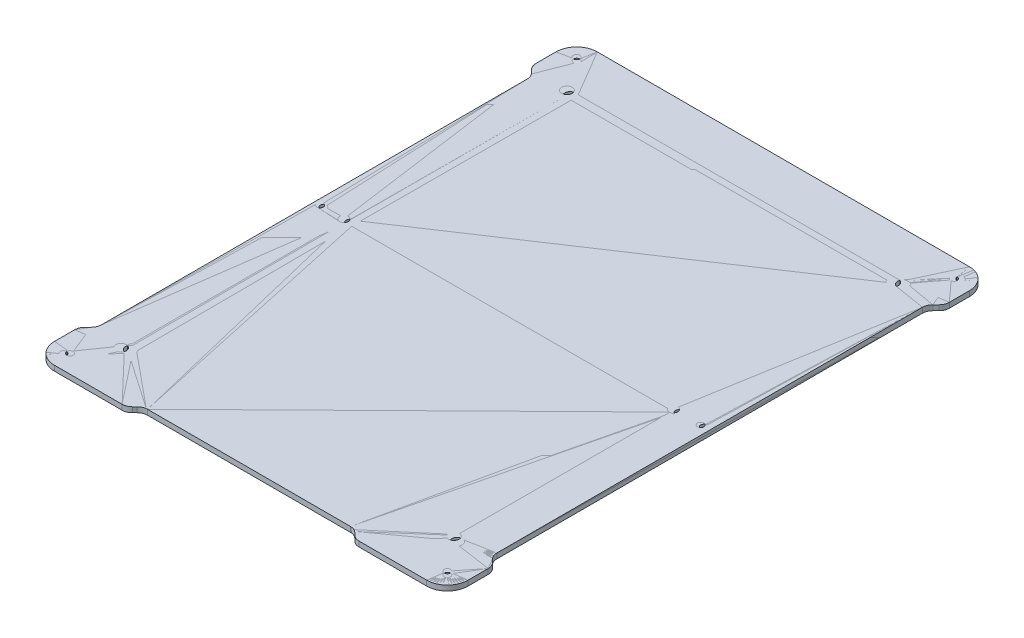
ISO-10303-21;
HEADER;
FILE_DESCRIPTION(('STEP AP214'),'2;1');
FILE_NAME('part.step','',(''),(''),'','','');
FILE_SCHEMA(('AUTOMOTIVE_DESIGN { 1 0 10303 214 1 1 1 1 }'));
ENDSEC;
DATA;
#1=APPLICATION_CONTEXT('core data for automotive mechanical design processes');
#2=APPLICATION_PROTOCOL_DEFINITION('international standard','automotive_design',2000,#1);
#3=PRODUCT_CONTEXT('',#1,'mechanical');
#4=PRODUCT('Part','Part','',(#3));
#5=PRODUCT_RELATED_PRODUCT_CATEGORY('part','',(#4));
#6=PRODUCT_DEFINITION_FORMATION('','',#4);
#7=PRODUCT_DEFINITION_CONTEXT('part definition',#1,'design');
#8=PRODUCT_DEFINITION('design','',#6,#7);
#9=PRODUCT_DEFINITION_SHAPE('','',#8);
#10=(LENGTH_UNIT() NAMED_UNIT(*) SI_UNIT(.MILLI.,.METRE.));
#11=(NAMED_UNIT(*) PLANE_ANGLE_UNIT() SI_UNIT($,.RADIAN.));
#12=(NAMED_UNIT(*) SI_UNIT($,.STERADIAN.) SOLID_ANGLE_UNIT());
#13=UNCERTAINTY_MEASURE_WITH_UNIT(LENGTH_MEASURE(1.E-05),#10,'distance_accuracy_value','');
#14=(GEOMETRIC_REPRESENTATION_CONTEXT(3) GLOBAL_UNCERTAINTY_ASSIGNED_CONTEXT((#13)) GLOBAL_UNIT_ASSIGNED_CONTEXT((#10,
#11,#12)) REPRESENTATION_CONTEXT('',''));
#15=CARTESIAN_POINT('',(0.,0.,0.));
#16=DIRECTION('',(0.,0.,1.));
#17=DIRECTION('',(1.,0.,0.));
#18=AXIS2_PLACEMENT_3D('',#15,#16,#17);
#19=CARTESIAN_POINT('',(160.,-4.,210.));
#20=DIRECTION('',(1.,0.,0.));
#21=DIRECTION('',(0.,0.,-1.));
#22=AXIS2_PLACEMENT_3D('',#19,#20,#21);
#23=PLANE('',#22);
#24=DIRECTION('',(0.,0.,-1.));
#25=VECTOR('',#24,1.);
#26=CARTESIAN_POINT('',(160.,-4.,210.));
#27=LINE('',#26,#25);
#28=CARTESIAN_POINT('',(160.,-4.,194.));
#29=VERTEX_POINT('',#28);
#30=CARTESIAN_POINT('',(160.,-4.,178.38477631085));
#31=VERTEX_POINT('',#30);
#32=EDGE_CURVE('E283',#29,#31,#27,.T.);
#33=ORIENTED_EDGE('',*,*,#32,.T.);
#34=DIRECTION('',(0.,1.,0.));
#35=VECTOR('',#34,1.);
#36=CARTESIAN_POINT('',(160.,-4.,178.38477631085));
#37=LINE('',#36,#35);
#38=CARTESIAN_POINT('',(160.,0.,178.38477631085));
#39=VERTEX_POINT('',#38);
#40=EDGE_CURVE('E366',#31,#39,#37,.T.);
#41=ORIENTED_EDGE('',*,*,#40,.T.);
#42=DIRECTION('',(0.,0.,-1.));
#43=VECTOR('',#42,1.);
#44=CARTESIAN_POINT('',(160.,0.,210.));
#45=LINE('',#44,#43);
#46=CARTESIAN_POINT('',(160.,0.,194.));
#47=VERTEX_POINT('',#46);
#48=EDGE_CURVE('E292',#47,#39,#45,.T.);
#49=ORIENTED_EDGE('',*,*,#48,.F.);
#50=DIRECTION('',(0.,1.,0.));
#51=VECTOR('',#50,1.);
#52=CARTESIAN_POINT('',(160.,-4.,194.));
#53=LINE('',#52,#51);
#54=EDGE_CURVE('E300',#47,#29,#53,.F.);
#55=ORIENTED_EDGE('',*,*,#54,.T.);
#56=EDGE_LOOP('',(#33,#41,#49,#55));
#57=FACE_BOUND('',#56,.T.);
#58=ADVANCED_FACE('F45',(#57),#23,.T.);
#59=CARTESIAN_POINT('',(160.,0.,-178.38477631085));
#60=VERTEX_POINT('',#59);
#61=CARTESIAN_POINT('',(160.,0.,-194.));
#62=VERTEX_POINT('',#61);
#63=EDGE_CURVE('E275',#60,#62,#45,.T.);
#64=ORIENTED_EDGE('',*,*,#63,.F.);
#65=DIRECTION('',(0.,-1.,0.));
#66=VECTOR('',#65,1.);
#67=CARTESIAN_POINT('',(160.,-4.,-178.38477631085));
#68=LINE('',#67,#66);
#69=CARTESIAN_POINT('',(160.,-4.,-178.38477631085));
#70=VERTEX_POINT('',#69);
#71=EDGE_CURVE('E359',#60,#70,#68,.T.);
#72=ORIENTED_EDGE('',*,*,#71,.T.);
#73=CARTESIAN_POINT('',(160.,-4.,-194.));
#74=VERTEX_POINT('',#73);
#75=EDGE_CURVE('E289',#70,#74,#27,.T.);
#76=ORIENTED_EDGE('',*,*,#75,.T.);
#77=DIRECTION('',(0.,1.,0.));
#78=VECTOR('',#77,1.);
#79=CARTESIAN_POINT('',(160.,-4.,-194.));
#80=LINE('',#79,#78);
#81=EDGE_CURVE('E297',#74,#62,#80,.T.);
#82=ORIENTED_EDGE('',*,*,#81,.T.);
#83=EDGE_LOOP('',(#64,#72,#76,#82));
#84=FACE_BOUND('',#83,.T.);
#85=ADVANCED_FACE('F601',(#84),#23,.T.);
#86=CARTESIAN_POINT('',(0.,-4.,0.));
#87=DIRECTION('',(0.,1.,0.));
#88=DIRECTION('',(0.,0.,1.));
#89=AXIS2_PLACEMENT_3D('',#86,#87,#88);
#90=PLANE('',#89);
#91=CARTESIAN_POINT('',(148.5,-4.,198.5));
#92=DIRECTION('',(0.,-1.,0.));
#93=DIRECTION('',(0.,0.,1.));
#94=AXIS2_PLACEMENT_3D('',#91,#92,#93);
#95=CIRCLE('',#94,2.49999999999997);
#96=CARTESIAN_POINT('',(148.5,-4.,201.));
#97=VERTEX_POINT('',#96);
#98=EDGE_CURVE('E1068',#97,#97,#95,.T.);
#99=ORIENTED_EDGE('',*,*,#98,.F.);
#100=EDGE_LOOP('',(#99));
#101=FACE_BOUND('',#100,.T.);
#102=CARTESIAN_POINT('',(148.5,-4.,-198.5));
#103=DIRECTION('',(0.,-1.,0.));
#104=DIRECTION('',(0.,0.,-1.));
#105=AXIS2_PLACEMENT_3D('',#102,#103,#104);
#106=CIRCLE('',#105,2.49999999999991);
#107=CARTESIAN_POINT('',(148.5,-4.,-201.));
#108=VERTEX_POINT('',#107);
#109=EDGE_CURVE('E1070',#108,#108,#106,.T.);
#110=ORIENTED_EDGE('',*,*,#109,.F.);
#111=EDGE_LOOP('',(#110));
#112=FACE_BOUND('',#111,.T.);
#113=CARTESIAN_POINT('',(-148.5,-4.,-198.5));
#114=DIRECTION('',(0.,-1.,0.));
#115=DIRECTION('',(0.,0.,1.));
#116=AXIS2_PLACEMENT_3D('',#113,#114,#115);
#117=CIRCLE('',#116,2.5);
#118=CARTESIAN_POINT('',(-148.5,-4.,-196.));
#119=VERTEX_POINT('',#118);
#120=EDGE_CURVE('E1075',#119,#119,#117,.T.);
#121=ORIENTED_EDGE('',*,*,#120,.F.);
#122=EDGE_LOOP('',(#121));
#123=FACE_BOUND('',#122,.T.);
#124=CARTESIAN_POINT('',(-148.5,-4.,0.));
#125=DIRECTION('',(0.,-1.,0.));
#126=DIRECTION('',(0.,0.,-1.));
#127=AXIS2_PLACEMENT_3D('',#124,#125,#126);
#128=CIRCLE('',#127,2.5);
#129=CARTESIAN_POINT('',(-148.5,-4.,-2.50000000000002));
#130=VERTEX_POINT('',#129);
#131=EDGE_CURVE('E1081',#130,#130,#128,.T.);
#132=ORIENTED_EDGE('',*,*,#131,.F.);
#133=EDGE_LOOP('',(#132));
#134=FACE_BOUND('',#133,.T.);
#135=CARTESIAN_POINT('',(148.5,-4.,0.));
#136=DIRECTION('',(0.,-1.,0.));
#137=DIRECTION('',(0.,0.,1.));
#138=AXIS2_PLACEMENT_3D('',#135,#136,#137);
#139=CIRCLE('',#138,2.5);
#140=CARTESIAN_POINT('',(148.5,-4.,2.5));
#141=VERTEX_POINT('',#140);
#142=EDGE_CURVE('E1078',#141,#141,#139,.T.);
#143=ORIENTED_EDGE('',*,*,#142,.F.);
#144=EDGE_LOOP('',(#143));
#145=FACE_BOUND('',#144,.T.);
#146=CARTESIAN_POINT('',(-148.5,-4.,198.5));
#147=DIRECTION('',(0.,-1.,0.));
#148=DIRECTION('',(0.,0.,-1.));
#149=AXIS2_PLACEMENT_3D('',#146,#147,#148);
#150=CIRCLE('',#149,2.5);
#151=CARTESIAN_POINT('',(-148.5,-4.,196.));
#152=VERTEX_POINT('',#151);
#153=EDGE_CURVE('E434',#152,#152,#150,.T.);
#154=ORIENTED_EDGE('',*,*,#153,.F.);
#155=EDGE_LOOP('',(#154));
#156=FACE_BOUND('',#155,.T.);
#157=CARTESIAN_POINT('',(130.,-4.,-172.5));
#158=DIRECTION('',(0.,1.,0.));
#159=DIRECTION('',(0.,0.,1.));
#160=AXIS2_PLACEMENT_3D('',#157,#158,#159);
#161=CIRCLE('',#160,4.09999999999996);
#162=CARTESIAN_POINT('',(130.,-4.,-168.4));
#163=VERTEX_POINT('',#162);
#164=EDGE_CURVE('E530',#163,#163,#161,.T.);
#165=ORIENTED_EDGE('',*,*,#164,.T.);
#166=EDGE_LOOP('',(#165));
#167=FACE_BOUND('',#166,.T.);
#168=CARTESIAN_POINT('',(-130.,-4.,-172.5));
#169=DIRECTION('',(0.,1.,0.));
#170=DIRECTION('',(0.,0.,-1.));
#171=AXIS2_PLACEMENT_3D('',#168,#169,#170);
#172=CIRCLE('',#171,4.09999999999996);
#173=CARTESIAN_POINT('',(-130.,-4.,-176.6));
#174=VERTEX_POINT('',#173);
#175=EDGE_CURVE('E524',#174,#174,#172,.T.);
#176=ORIENTED_EDGE('',*,*,#175,.T.);
#177=EDGE_LOOP('',(#176));
#178=FACE_BOUND('',#177,.T.);
#179=CARTESIAN_POINT('',(-130.,-4.,172.5));
#180=DIRECTION('',(0.,1.,0.));
#181=DIRECTION('',(0.,0.,1.));
#182=AXIS2_PLACEMENT_3D('',#179,#180,#181);
#183=CIRCLE('',#182,4.09999999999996);
#184=CARTESIAN_POINT('',(-130.,-4.,176.6));
#185=VERTEX_POINT('',#184);
#186=EDGE_CURVE('E518',#185,#185,#183,.T.);
#187=ORIENTED_EDGE('',*,*,#186,.T.);
#188=EDGE_LOOP('',(#187));
#189=FACE_BOUND('',#188,.T.);
#190=CARTESIAN_POINT('',(130.,-4.,172.5));
#191=DIRECTION('',(0.,1.,0.));
#192=DIRECTION('',(0.,0.,-1.));
#193=AXIS2_PLACEMENT_3D('',#190,#191,#192);
#194=CIRCLE('',#193,4.09999999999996);
#195=CARTESIAN_POINT('',(130.,-4.,168.4));
#196=VERTEX_POINT('',#195);
#197=EDGE_CURVE('E512',#196,#196,#194,.T.);
#198=ORIENTED_EDGE('',*,*,#197,.T.);
#199=EDGE_LOOP('',(#198));
#200=FACE_BOUND('',#199,.T.);
#201=CARTESIAN_POINT('',(-130.,-4.,0.));
#202=DIRECTION('',(0.,1.,0.));
#203=DIRECTION('',(0.,0.,1.));
#204=AXIS2_PLACEMENT_3D('',#201,#202,#203);
#205=CIRCLE('',#204,3.40000000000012);
#206=CARTESIAN_POINT('',(-130.,-4.,3.40000000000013));
#207=VERTEX_POINT('',#206);
#208=EDGE_CURVE('E506',#207,#207,#205,.T.);
#209=ORIENTED_EDGE('',*,*,#208,.T.);
#210=EDGE_LOOP('',(#209));
#211=FACE_BOUND('',#210,.T.);
#212=CARTESIAN_POINT('',(130.,-4.,0.));
#213=DIRECTION('',(0.,1.,0.));
#214=DIRECTION('',(0.,0.,-1.));
#215=AXIS2_PLACEMENT_3D('',#212,#213,#214);
#216=CIRCLE('',#215,3.40000000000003);
#217=CARTESIAN_POINT('',(130.,-4.,-3.40000000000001));
#218=VERTEX_POINT('',#217);
#219=EDGE_CURVE('E500',#218,#218,#216,.T.);
#220=ORIENTED_EDGE('',*,*,#219,.T.);
#221=EDGE_LOOP('',(#220));
#222=FACE_BOUND('',#221,.T.);
#223=DIRECTION('',(-0.707106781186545,0.,-0.70710678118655));
#224=VECTOR('',#223,1.);
#225=CARTESIAN_POINT('',(7.53553390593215,-4.,-7.53553390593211));
#226=LINE('',#225,#224);
#227=CARTESIAN_POINT('',(-155.272077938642,-4.,-170.343145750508));
#228=VERTEX_POINT('',#227);
#229=CARTESIAN_POINT('',(-157.656854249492,-4.,-172.727922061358));
#230=VERTEX_POINT('',#229);
#231=EDGE_CURVE('E493',#228,#230,#226,.T.);
#232=ORIENTED_EDGE('',*,*,#231,.T.);
#233=CARTESIAN_POINT('',(-152.,-4.,-178.38477631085));
#234=DIRECTION('',(0.,1.,0.));
#235=DIRECTION('',(0.,0.,1.));
#236=AXIS2_PLACEMENT_3D('',#233,#234,#235);
#237=CIRCLE('',#236,8.);
#238=CARTESIAN_POINT('',(-160.,-4.,-178.38477631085));
#239=VERTEX_POINT('',#238);
#240=EDGE_CURVE('E344',#230,#239,#237,.F.);
#241=ORIENTED_EDGE('',*,*,#240,.T.);
#242=DIRECTION('',(0.,0.,1.));
#243=VECTOR('',#242,1.);
#244=CARTESIAN_POINT('',(-160.,-4.,-210.));
#245=LINE('',#244,#243);
#246=CARTESIAN_POINT('',(-160.,-4.,-194.));
#247=VERTEX_POINT('',#246);
#248=EDGE_CURVE('E540',#247,#239,#245,.T.);
#249=ORIENTED_EDGE('',*,*,#248,.F.);
#250=CARTESIAN_POINT('',(-144.,-4.,-194.));
#251=DIRECTION('',(0.,1.,0.));
#252=DIRECTION('',(0.,0.,1.));
#253=AXIS2_PLACEMENT_3D('',#250,#251,#252);
#254=CIRCLE('',#253,16.);
#255=CARTESIAN_POINT('',(-144.,-4.,-210.));
#256=VERTEX_POINT('',#255);
#257=EDGE_CURVE('E302',#247,#256,#254,.F.);
#258=ORIENTED_EDGE('',*,*,#257,.T.);
#259=DIRECTION('',(-1.,0.,0.));
#260=VECTOR('',#259,1.);
#261=CARTESIAN_POINT('',(160.,-4.,-210.));
#262=LINE('',#261,#260);
#263=CARTESIAN_POINT('',(144.,-4.,-210.));
#264=VERTEX_POINT('',#263);
#265=EDGE_CURVE('E536',#264,#256,#262,.T.);
#266=ORIENTED_EDGE('',*,*,#265,.F.);
#267=CARTESIAN_POINT('',(144.,-4.,-194.));
#268=DIRECTION('',(0.,1.,0.));
#269=DIRECTION('',(0.,0.,1.));
#270=AXIS2_PLACEMENT_3D('',#267,#268,#269);
#271=CIRCLE('',#270,16.);
#272=EDGE_CURVE('E304',#264,#74,#271,.F.);
#273=ORIENTED_EDGE('',*,*,#272,.T.);
#274=ORIENTED_EDGE('',*,*,#75,.F.);
#275=CARTESIAN_POINT('',(152.,-4.,-178.38477631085));
#276=DIRECTION('',(0.,1.,0.));
#277=DIRECTION('',(0.,0.,1.));
#278=AXIS2_PLACEMENT_3D('',#275,#276,#277);
#279=CIRCLE('',#278,8.);
#280=CARTESIAN_POINT('',(157.656854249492,-4.,-172.727922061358));
#281=VERTEX_POINT('',#280);
#282=EDGE_CURVE('E342',#70,#281,#279,.F.);
#283=ORIENTED_EDGE('',*,*,#282,.T.);
#284=DIRECTION('',(0.707106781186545,0.,-0.70710678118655));
#285=VECTOR('',#284,1.);
#286=CARTESIAN_POINT('',(-7.53553390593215,-4.,-7.53553390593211));
#287=LINE('',#286,#285);
#288=CARTESIAN_POINT('',(155.272077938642,-4.,-170.343145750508));
#289=VERTEX_POINT('',#288);
#290=EDGE_CURVE('E456',#289,#281,#287,.T.);
#291=ORIENTED_EDGE('',*,*,#290,.F.);
#292=CARTESIAN_POINT('',(160.928932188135,-4.,-164.686291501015));
#293=DIRECTION('',(0.,1.,0.));
#294=DIRECTION('',(0.,0.,1.));
#295=AXIS2_PLACEMENT_3D('',#292,#293,#294);
#296=CIRCLE('',#295,8.);
#297=CARTESIAN_POINT('',(152.928932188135,-4.,-164.686291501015));
#298=VERTEX_POINT('',#297);
#299=EDGE_CURVE('E416',#289,#298,#296,.T.);
#300=ORIENTED_EDGE('',*,*,#299,.T.);
#301=DIRECTION('',(0.,0.,-1.));
#302=VECTOR('',#301,1.);
#303=CARTESIAN_POINT('',(152.928932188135,-4.,0.));
#304=LINE('',#303,#302);
#305=CARTESIAN_POINT('',(152.928932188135,-4.,164.686291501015));
#306=VERTEX_POINT('',#305);
#307=EDGE_CURVE('E463',#306,#298,#304,.T.);
#308=ORIENTED_EDGE('',*,*,#307,.F.);
#309=CARTESIAN_POINT('',(160.928932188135,-4.,164.686291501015));
#310=DIRECTION('',(0.,1.,0.));
#311=DIRECTION('',(0.,0.,1.));
#312=AXIS2_PLACEMENT_3D('',#309,#310,#311);
#313=CIRCLE('',#312,8.);
#314=CARTESIAN_POINT('',(155.272077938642,-4.,170.343145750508));
#315=VERTEX_POINT('',#314);
#316=EDGE_CURVE('E412',#306,#315,#313,.T.);
#317=ORIENTED_EDGE('',*,*,#316,.T.);
#318=DIRECTION('',(-0.707106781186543,0.,-0.707106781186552));
#319=VECTOR('',#318,1.);
#320=CARTESIAN_POINT('',(-7.5355339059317,-4.,7.53553390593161));
#321=LINE('',#320,#319);
#322=CARTESIAN_POINT('',(157.656854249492,-4.,172.727922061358));
#323=VERTEX_POINT('',#322);
#324=EDGE_CURVE('E466',#323,#315,#321,.T.);
#325=ORIENTED_EDGE('',*,*,#324,.F.);
#326=CARTESIAN_POINT('',(152.,-4.,178.38477631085));
#327=DIRECTION('',(0.,1.,0.));
#328=DIRECTION('',(0.,0.,1.));
#329=AXIS2_PLACEMENT_3D('',#326,#327,#328);
#330=CIRCLE('',#329,8.);
#331=EDGE_CURVE('E340',#323,#31,#330,.F.);
#332=ORIENTED_EDGE('',*,*,#331,.T.);
#333=ORIENTED_EDGE('',*,*,#32,.F.);
#334=CARTESIAN_POINT('',(144.,-4.,194.));
#335=DIRECTION('',(0.,1.,0.));
#336=DIRECTION('',(0.,0.,1.));
#337=AXIS2_PLACEMENT_3D('',#334,#335,#336);
#338=CIRCLE('',#337,16.);
#339=CARTESIAN_POINT('',(144.,-4.,210.));
#340=VERTEX_POINT('',#339);
#341=EDGE_CURVE('E308',#29,#340,#338,.F.);
#342=ORIENTED_EDGE('',*,*,#341,.T.);
#343=DIRECTION('',(1.,0.,0.));
#344=VECTOR('',#343,1.);
#345=CARTESIAN_POINT('',(-160.,-4.,210.));
#346=LINE('',#345,#344);
#347=CARTESIAN_POINT('',(91.6803939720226,-4.,210.));
#348=VERTEX_POINT('',#347);
#349=EDGE_CURVE('E543',#348,#340,#346,.T.);
#350=ORIENTED_EDGE('',*,*,#349,.F.);
#351=CARTESIAN_POINT('',(91.6803939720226,-4.,202.));
#352=DIRECTION('',(0.,1.,0.));
#353=DIRECTION('',(0.,0.,1.));
#354=AXIS2_PLACEMENT_3D('',#351,#352,#353);
#355=CIRCLE('',#354,8.);
#356=CARTESIAN_POINT('',(86.0235397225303,-4.,207.656854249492));
#357=VERTEX_POINT('',#356);
#358=EDGE_CURVE('E334',#348,#357,#355,.F.);
#359=ORIENTED_EDGE('',*,*,#358,.T.);
#360=DIRECTION('',(-0.707106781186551,0.,-0.707106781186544));
#361=VECTOR('',#360,1.);
#362=CARTESIAN_POINT('',(-60.8166572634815,-4.,60.8166572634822));
#363=LINE('',#362,#361);
#364=CARTESIAN_POINT('',(84.2010101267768,-4.,205.834324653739));
#365=VERTEX_POINT('',#364);
#366=EDGE_CURVE('E481',#357,#365,#363,.T.);
#367=ORIENTED_EDGE('',*,*,#366,.T.);
#368=CARTESIAN_POINT('',(78.5441558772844,-4.,211.491178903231));
#369=DIRECTION('',(0.,1.,0.));
#370=DIRECTION('',(0.,0.,1.));
#371=AXIS2_PLACEMENT_3D('',#368,#369,#370);
#372=CIRCLE('',#371,8.);
#373=CARTESIAN_POINT('',(78.5441558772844,-4.,203.491178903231));
#374=VERTEX_POINT('',#373);
#375=EDGE_CURVE('E423',#365,#374,#372,.T.);
#376=ORIENTED_EDGE('',*,*,#375,.T.);
#377=DIRECTION('',(-1.,0.,0.));
#378=VECTOR('',#377,1.);
#379=CARTESIAN_POINT('',(2.27692830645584E-12,-4.,203.491178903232));
#380=LINE('',#379,#378);
#381=CARTESIAN_POINT('',(-78.5441558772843,-4.,203.491178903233));
#382=VERTEX_POINT('',#381);
#383=EDGE_CURVE('E475',#374,#382,#380,.T.);
#384=ORIENTED_EDGE('',*,*,#383,.T.);
#385=CARTESIAN_POINT('',(-78.5441558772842,-4.,211.491178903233));
#386=DIRECTION('',(0.,1.,0.));
#387=DIRECTION('',(0.,0.,1.));
#388=AXIS2_PLACEMENT_3D('',#385,#386,#387);
#389=CIRCLE('',#388,8.);
#390=CARTESIAN_POINT('',(-84.2010101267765,-4.,205.834324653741));
#391=VERTEX_POINT('',#390);
#392=EDGE_CURVE('E420',#382,#391,#389,.T.);
#393=ORIENTED_EDGE('',*,*,#392,.T.);
#394=DIRECTION('',(-0.707106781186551,0.,0.707106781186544));
#395=VECTOR('',#394,1.);
#396=CARTESIAN_POINT('',(60.8166572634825,-4.,60.8166572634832));
#397=LINE('',#396,#395);
#398=CARTESIAN_POINT('',(-86.0235397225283,-4.,207.656854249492));
#399=VERTEX_POINT('',#398);
#400=EDGE_CURVE('E478',#391,#399,#397,.T.);
#401=ORIENTED_EDGE('',*,*,#400,.T.);
#402=CARTESIAN_POINT('',(-91.6803939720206,-4.,202.));
#403=DIRECTION('',(0.,1.,0.));
#404=DIRECTION('',(0.,0.,1.));
#405=AXIS2_PLACEMENT_3D('',#402,#403,#404);
#406=CIRCLE('',#405,8.);
#407=CARTESIAN_POINT('',(-91.6803939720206,-4.,210.));
#408=VERTEX_POINT('',#407);
#409=EDGE_CURVE('E336',#399,#408,#406,.F.);
#410=ORIENTED_EDGE('',*,*,#409,.T.);
#411=CARTESIAN_POINT('',(-144.,-4.,210.));
#412=VERTEX_POINT('',#411);
#413=EDGE_CURVE('E544',#412,#408,#346,.T.);
#414=ORIENTED_EDGE('',*,*,#413,.F.);
#415=CARTESIAN_POINT('',(-144.,-4.,194.));
#416=DIRECTION('',(0.,1.,0.));
#417=DIRECTION('',(0.,0.,1.));
#418=AXIS2_PLACEMENT_3D('',#415,#416,#417);
#419=CIRCLE('',#418,16.);
#420=CARTESIAN_POINT('',(-160.,-4.,194.));
#421=VERTEX_POINT('',#420);
#422=EDGE_CURVE('E281',#412,#421,#419,.F.);
#423=ORIENTED_EDGE('',*,*,#422,.T.);
#424=CARTESIAN_POINT('',(-160.,-4.,178.38477631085));
#425=VERTEX_POINT('',#424);
#426=EDGE_CURVE('E539',#425,#421,#245,.T.);
#427=ORIENTED_EDGE('',*,*,#426,.F.);
#428=CARTESIAN_POINT('',(-152.,-4.,178.38477631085));
#429=DIRECTION('',(0.,1.,0.));
#430=DIRECTION('',(0.,0.,1.));
#431=AXIS2_PLACEMENT_3D('',#428,#429,#430);
#432=CIRCLE('',#431,8.);
#433=CARTESIAN_POINT('',(-157.656854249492,-4.,172.727922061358));
#434=VERTEX_POINT('',#433);
#435=EDGE_CURVE('E338',#425,#434,#432,.F.);
#436=ORIENTED_EDGE('',*,*,#435,.T.);
#437=DIRECTION('',(0.707106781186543,0.,-0.707106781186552));
#438=VECTOR('',#437,1.);
#439=CARTESIAN_POINT('',(7.5355339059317,-4.,7.53553390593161));
#440=LINE('',#439,#438);
#441=CARTESIAN_POINT('',(-155.272077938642,-4.,170.343145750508));
#442=VERTEX_POINT('',#441);
#443=EDGE_CURVE('E496',#434,#442,#440,.T.);
#444=ORIENTED_EDGE('',*,*,#443,.T.);
#445=CARTESIAN_POINT('',(-160.928932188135,-4.,164.686291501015));
#446=DIRECTION('',(0.,1.,0.));
#447=DIRECTION('',(0.,0.,1.));
#448=AXIS2_PLACEMENT_3D('',#445,#446,#447);
#449=CIRCLE('',#448,8.);
#450=CARTESIAN_POINT('',(-152.928932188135,-4.,164.686291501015));
#451=VERTEX_POINT('',#450);
#452=EDGE_CURVE('E427',#442,#451,#449,.T.);
#453=ORIENTED_EDGE('',*,*,#452,.T.);
#454=DIRECTION('',(0.,0.,-1.));
#455=VECTOR('',#454,1.);
#456=CARTESIAN_POINT('',(-152.928932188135,-4.,0.));
#457=LINE('',#456,#455);
#458=CARTESIAN_POINT('',(-152.928932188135,-4.,-164.686291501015));
#459=VERTEX_POINT('',#458);
#460=EDGE_CURVE('E490',#451,#459,#457,.T.);
#461=ORIENTED_EDGE('',*,*,#460,.T.);
#462=CARTESIAN_POINT('',(-160.928932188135,-4.,-164.686291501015));
#463=DIRECTION('',(0.,1.,0.));
#464=DIRECTION('',(0.,0.,1.));
#465=AXIS2_PLACEMENT_3D('',#462,#463,#464);
#466=CIRCLE('',#465,8.);
#467=EDGE_CURVE('E12',#459,#228,#466,.T.);
#468=ORIENTED_EDGE('',*,*,#467,.T.);
#469=EDGE_LOOP('',(#232,#241,#249,#258,#266,#273,#274,#283,#291,#300,#308,#317,#325,#332,#333,
#342,#350,#359,#367,#376,#384,#393,#401,#410,#414,#423,#427,#436,#444,#453,#461,#468));
#470=FACE_BOUND('',#469,.T.);
#471=ADVANCED_FACE('F566',(#101,#112,#123,#134,#145,#156,#167,#178,#189,#200,#211,#222,#470),
#90,.F.);
#472=CARTESIAN_POINT('',(0.,0.,0.));
#473=DIRECTION('',(0.,1.,0.));
#474=DIRECTION('',(0.,0.,1.));
#475=AXIS2_PLACEMENT_3D('',#472,#473,#474);
#476=PLANE('',#475);
#477=CARTESIAN_POINT('',(148.5,0.,198.5));
#478=DIRECTION('',(0.,1.,0.));
#479=DIRECTION('',(0.,0.,1.));
#480=AXIS2_PLACEMENT_3D('',#477,#478,#479);
#481=CIRCLE('',#480,2.49999999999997);
#482=CARTESIAN_POINT('',(148.5,0.,201.));
#483=VERTEX_POINT('',#482);
#484=EDGE_CURVE('E49',#483,#483,#481,.T.);
#485=ORIENTED_EDGE('',*,*,#484,.F.);
#486=EDGE_LOOP('',(#485));
#487=FACE_BOUND('',#486,.T.);
#488=CARTESIAN_POINT('',(148.5,0.,-198.5));
#489=DIRECTION('',(0.,1.,0.));
#490=DIRECTION('',(0.,0.,1.));
#491=AXIS2_PLACEMENT_3D('',#488,#489,#490);
#492=CIRCLE('',#491,2.49999999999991);
#493=CARTESIAN_POINT('',(148.5,0.,-196.));
#494=VERTEX_POINT('',#493);
#495=EDGE_CURVE('E442',#494,#494,#492,.T.);
#496=ORIENTED_EDGE('',*,*,#495,.F.);
#497=EDGE_LOOP('',(#496));
#498=FACE_BOUND('',#497,.T.);
#499=CARTESIAN_POINT('',(-148.5,0.,-198.5));
#500=DIRECTION('',(0.,1.,0.));
#501=DIRECTION('',(0.,0.,1.));
#502=AXIS2_PLACEMENT_3D('',#499,#500,#501);
#503=CIRCLE('',#502,2.5);
#504=CARTESIAN_POINT('',(-148.5,0.,-196.));
#505=VERTEX_POINT('',#504);
#506=EDGE_CURVE('E440',#505,#505,#503,.T.);
#507=ORIENTED_EDGE('',*,*,#506,.F.);
#508=EDGE_LOOP('',(#507));
#509=FACE_BOUND('',#508,.T.);
#510=CARTESIAN_POINT('',(-148.5,0.,0.));
#511=DIRECTION('',(0.,1.,0.));
#512=DIRECTION('',(0.,0.,1.));
#513=AXIS2_PLACEMENT_3D('',#510,#511,#512);
#514=CIRCLE('',#513,2.5);
#515=CARTESIAN_POINT('',(-148.5,0.,2.49999999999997));
#516=VERTEX_POINT('',#515);
#517=EDGE_CURVE('E437',#516,#516,#514,.T.);
#518=ORIENTED_EDGE('',*,*,#517,.F.);
#519=EDGE_LOOP('',(#518));
#520=FACE_BOUND('',#519,.T.);
#521=CARTESIAN_POINT('',(148.5,0.,0.));
#522=DIRECTION('',(0.,1.,0.));
#523=DIRECTION('',(0.,0.,1.));
#524=AXIS2_PLACEMENT_3D('',#521,#522,#523);
#525=CIRCLE('',#524,2.5);
#526=CARTESIAN_POINT('',(148.5,0.,2.5));
#527=VERTEX_POINT('',#526);
#528=EDGE_CURVE('E433',#527,#527,#525,.T.);
#529=ORIENTED_EDGE('',*,*,#528,.F.);
#530=EDGE_LOOP('',(#529));
#531=FACE_BOUND('',#530,.T.);
#532=CARTESIAN_POINT('',(-148.5,0.,198.5));
#533=DIRECTION('',(0.,1.,0.));
#534=DIRECTION('',(0.,0.,1.));
#535=AXIS2_PLACEMENT_3D('',#532,#533,#534);
#536=CIRCLE('',#535,2.5);
#537=CARTESIAN_POINT('',(-148.5,0.,201.));
#538=VERTEX_POINT('',#537);
#539=EDGE_CURVE('E430',#538,#538,#536,.T.);
#540=ORIENTED_EDGE('',*,*,#539,.F.);
#541=EDGE_LOOP('',(#540));
#542=FACE_BOUND('',#541,.T.);
#543=CARTESIAN_POINT('',(130.,0.,0.));
#544=DIRECTION('',(0.,1.,0.));
#545=DIRECTION('',(0.,0.,-1.));
#546=AXIS2_PLACEMENT_3D('',#543,#544,#545);
#547=CIRCLE('',#546,3.40000000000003);
#548=CARTESIAN_POINT('',(130.,0.,-3.40000000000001));
#549=VERTEX_POINT('',#548);
#550=EDGE_CURVE('E499',#549,#549,#547,.T.);
#551=ORIENTED_EDGE('',*,*,#550,.F.);
#552=EDGE_LOOP('',(#551));
#553=FACE_BOUND('',#552,.T.);
#554=CARTESIAN_POINT('',(-130.,0.,0.));
#555=DIRECTION('',(0.,1.,0.));
#556=DIRECTION('',(0.,0.,1.));
#557=AXIS2_PLACEMENT_3D('',#554,#555,#556);
#558=CIRCLE('',#557,3.40000000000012);
#559=CARTESIAN_POINT('',(-130.,0.,3.40000000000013));
#560=VERTEX_POINT('',#559);
#561=EDGE_CURVE('E503',#560,#560,#558,.T.);
#562=ORIENTED_EDGE('',*,*,#561,.F.);
#563=EDGE_LOOP('',(#562));
#564=FACE_BOUND('',#563,.T.);
#565=CARTESIAN_POINT('',(130.,0.,172.5));
#566=DIRECTION('',(0.,1.,0.));
#567=DIRECTION('',(0.,0.,-1.));
#568=AXIS2_PLACEMENT_3D('',#565,#566,#567);
#569=CIRCLE('',#568,4.09999999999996);
#570=CARTESIAN_POINT('',(130.,0.,168.4));
#571=VERTEX_POINT('',#570);
#572=EDGE_CURVE('E509',#571,#571,#569,.T.);
#573=ORIENTED_EDGE('',*,*,#572,.F.);
#574=EDGE_LOOP('',(#573));
#575=FACE_BOUND('',#574,.T.);
#576=CARTESIAN_POINT('',(-130.,0.,172.5));
#577=DIRECTION('',(0.,1.,0.));
#578=DIRECTION('',(0.,0.,1.));
#579=AXIS2_PLACEMENT_3D('',#576,#577,#578);
#580=CIRCLE('',#579,4.09999999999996);
#581=CARTESIAN_POINT('',(-130.,0.,176.6));
#582=VERTEX_POINT('',#581);
#583=EDGE_CURVE('E515',#582,#582,#580,.T.);
#584=ORIENTED_EDGE('',*,*,#583,.F.);
#585=EDGE_LOOP('',(#584));
#586=FACE_BOUND('',#585,.T.);
#587=CARTESIAN_POINT('',(-130.,0.,-172.5));
#588=DIRECTION('',(0.,1.,0.));
#589=DIRECTION('',(0.,0.,-1.));
#590=AXIS2_PLACEMENT_3D('',#587,#588,#589);
#591=CIRCLE('',#590,4.09999999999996);
#592=CARTESIAN_POINT('',(-130.,0.,-176.6));
#593=VERTEX_POINT('',#592);
#594=EDGE_CURVE('E521',#593,#593,#591,.T.);
#595=ORIENTED_EDGE('',*,*,#594,.F.);
#596=EDGE_LOOP('',(#595));
#597=FACE_BOUND('',#596,.T.);
#598=CARTESIAN_POINT('',(130.,0.,-172.5));
#599=DIRECTION('',(0.,1.,0.));
#600=DIRECTION('',(0.,0.,1.));
#601=AXIS2_PLACEMENT_3D('',#598,#599,#600);
#602=CIRCLE('',#601,4.09999999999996);
#603=CARTESIAN_POINT('',(130.,0.,-168.4));
#604=VERTEX_POINT('',#603);
#605=EDGE_CURVE('E527',#604,#604,#602,.T.);
#606=ORIENTED_EDGE('',*,*,#605,.F.);
#607=EDGE_LOOP('',(#606));
#608=FACE_BOUND('',#607,.T.);
#609=DIRECTION('',(0.,0.,1.));
#610=VECTOR('',#609,1.);
#611=CARTESIAN_POINT('',(-160.,0.,-210.));
#612=LINE('',#611,#610);
#613=CARTESIAN_POINT('',(-160.,0.,-194.));
#614=VERTEX_POINT('',#613);
#615=CARTESIAN_POINT('',(-160.,0.,-178.38477631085));
#616=VERTEX_POINT('',#615);
#617=EDGE_CURVE('E548',#614,#616,#612,.T.);
#618=ORIENTED_EDGE('',*,*,#617,.T.);
#619=CARTESIAN_POINT('',(-152.,0.,-178.38477631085));
#620=DIRECTION('',(0.,1.,0.));
#621=DIRECTION('',(0.,0.,1.));
#622=AXIS2_PLACEMENT_3D('',#619,#620,#621);
#623=CIRCLE('',#622,8.);
#624=CARTESIAN_POINT('',(-157.656854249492,0.,-172.727922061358));
#625=VERTEX_POINT('',#624);
#626=EDGE_CURVE('E357',#616,#625,#623,.T.);
#627=ORIENTED_EDGE('',*,*,#626,.T.);
#628=DIRECTION('',(-0.707106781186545,0.,-0.70710678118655));
#629=VECTOR('',#628,1.);
#630=CARTESIAN_POINT('',(-152.928932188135,0.,-168.));
#631=LINE('',#630,#629);
#632=CARTESIAN_POINT('',(-155.272077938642,0.,-170.343145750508));
#633=VERTEX_POINT('',#632);
#634=EDGE_CURVE('E487',#633,#625,#631,.T.);
#635=ORIENTED_EDGE('',*,*,#634,.F.);
#636=CARTESIAN_POINT('',(-160.928932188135,0.,-164.686291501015));
#637=DIRECTION('',(0.,1.,0.));
#638=DIRECTION('',(0.,0.,1.));
#639=AXIS2_PLACEMENT_3D('',#636,#637,#638);
#640=CIRCLE('',#639,8.);
#641=CARTESIAN_POINT('',(-152.928932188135,0.,-164.686291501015));
#642=VERTEX_POINT('',#641);
#643=EDGE_CURVE('E54',#633,#642,#640,.F.);
#644=ORIENTED_EDGE('',*,*,#643,.T.);
#645=DIRECTION('',(0.,0.,-1.));
#646=VECTOR('',#645,1.);
#647=CARTESIAN_POINT('',(-152.928932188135,0.,168.));
#648=LINE('',#647,#646);
#649=CARTESIAN_POINT('',(-152.928932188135,0.,164.686291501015));
#650=VERTEX_POINT('',#649);
#651=EDGE_CURVE('E484',#650,#642,#648,.T.);
#652=ORIENTED_EDGE('',*,*,#651,.F.);
#653=CARTESIAN_POINT('',(-160.928932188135,0.,164.686291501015));
#654=DIRECTION('',(0.,1.,0.));
#655=DIRECTION('',(0.,0.,1.));
#656=AXIS2_PLACEMENT_3D('',#653,#654,#655);
#657=CIRCLE('',#656,8.);
#658=CARTESIAN_POINT('',(-155.272077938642,0.,170.343145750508));
#659=VERTEX_POINT('',#658);
#660=EDGE_CURVE('E425',#650,#659,#657,.F.);
#661=ORIENTED_EDGE('',*,*,#660,.T.);
#662=DIRECTION('',(0.707106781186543,0.,-0.707106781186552));
#663=VECTOR('',#662,1.);
#664=CARTESIAN_POINT('',(7.5355339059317,0.,7.53553390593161));
#665=LINE('',#664,#663);
#666=CARTESIAN_POINT('',(-157.656854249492,0.,172.727922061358));
#667=VERTEX_POINT('',#666);
#668=EDGE_CURVE('E320',#667,#659,#665,.T.);
#669=ORIENTED_EDGE('',*,*,#668,.F.);
#670=CARTESIAN_POINT('',(-152.,0.,178.38477631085));
#671=DIRECTION('',(0.,1.,0.));
#672=DIRECTION('',(0.,0.,1.));
#673=AXIS2_PLACEMENT_3D('',#670,#671,#672);
#674=CIRCLE('',#673,8.);
#675=CARTESIAN_POINT('',(-160.,0.,178.38477631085));
#676=VERTEX_POINT('',#675);
#677=EDGE_CURVE('E351',#667,#676,#674,.T.);
#678=ORIENTED_EDGE('',*,*,#677,.T.);
#679=CARTESIAN_POINT('',(-160.,0.,194.));
#680=VERTEX_POINT('',#679);
#681=EDGE_CURVE('E260',#676,#680,#612,.T.);
#682=ORIENTED_EDGE('',*,*,#681,.T.);
#683=CARTESIAN_POINT('',(-144.,0.,194.));
#684=DIRECTION('',(0.,1.,0.));
#685=DIRECTION('',(0.,0.,1.));
#686=AXIS2_PLACEMENT_3D('',#683,#684,#685);
#687=CIRCLE('',#686,16.);
#688=CARTESIAN_POINT('',(-144.,0.,210.));
#689=VERTEX_POINT('',#688);
#690=EDGE_CURVE('E253',#680,#689,#687,.T.);
#691=ORIENTED_EDGE('',*,*,#690,.T.);
#692=DIRECTION('',(1.,0.,0.));
#693=VECTOR('',#692,1.);
#694=CARTESIAN_POINT('',(-160.,0.,210.));
#695=LINE('',#694,#693);
#696=CARTESIAN_POINT('',(-91.6803939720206,0.,210.));
#697=VERTEX_POINT('',#696);
#698=EDGE_CURVE('E257',#689,#697,#695,.T.);
#699=ORIENTED_EDGE('',*,*,#698,.T.);
#700=CARTESIAN_POINT('',(-91.6803939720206,0.,202.));
#701=DIRECTION('',(0.,1.,0.));
#702=DIRECTION('',(0.,0.,1.));
#703=AXIS2_PLACEMENT_3D('',#700,#701,#702);
#704=CIRCLE('',#703,8.);
#705=CARTESIAN_POINT('',(-86.0235397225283,0.,207.656854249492));
#706=VERTEX_POINT('',#705);
#707=EDGE_CURVE('E349',#697,#706,#704,.T.);
#708=ORIENTED_EDGE('',*,*,#707,.T.);
#709=DIRECTION('',(-0.707106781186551,0.,0.707106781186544));
#710=VECTOR('',#709,1.);
#711=CARTESIAN_POINT('',(-81.8578643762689,0.,203.491178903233));
#712=LINE('',#711,#710);
#713=CARTESIAN_POINT('',(-84.2010101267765,0.,205.834324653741));
#714=VERTEX_POINT('',#713);
#715=EDGE_CURVE('E472',#714,#706,#712,.T.);
#716=ORIENTED_EDGE('',*,*,#715,.F.);
#717=CARTESIAN_POINT('',(-78.5441558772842,0.,211.491178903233));
#718=DIRECTION('',(0.,1.,0.));
#719=DIRECTION('',(0.,0.,1.));
#720=AXIS2_PLACEMENT_3D('',#717,#718,#719);
#721=CIRCLE('',#720,8.);
#722=CARTESIAN_POINT('',(-78.5441558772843,0.,203.491178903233));
#723=VERTEX_POINT('',#722);
#724=EDGE_CURVE('E418',#714,#723,#721,.F.);
#725=ORIENTED_EDGE('',*,*,#724,.T.);
#726=DIRECTION('',(-1.,0.,0.));
#727=VECTOR('',#726,1.);
#728=CARTESIAN_POINT('',(-81.8578643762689,0.,203.491178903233));
#729=LINE('',#728,#727);
#730=CARTESIAN_POINT('',(78.5441558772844,0.,203.491178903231));
#731=VERTEX_POINT('',#730);
#732=EDGE_CURVE('E469',#731,#723,#729,.T.);
#733=ORIENTED_EDGE('',*,*,#732,.F.);
#734=CARTESIAN_POINT('',(78.5441558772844,0.,211.491178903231));
#735=DIRECTION('',(0.,1.,0.));
#736=DIRECTION('',(0.,0.,1.));
#737=AXIS2_PLACEMENT_3D('',#734,#735,#736);
#738=CIRCLE('',#737,8.);
#739=CARTESIAN_POINT('',(84.2010101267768,0.,205.834324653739));
#740=VERTEX_POINT('',#739);
#741=EDGE_CURVE('E68',#731,#740,#738,.F.);
#742=ORIENTED_EDGE('',*,*,#741,.T.);
#743=DIRECTION('',(-0.707106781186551,0.,-0.707106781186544));
#744=VECTOR('',#743,1.);
#745=CARTESIAN_POINT('',(-60.8166572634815,0.,60.8166572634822));
#746=LINE('',#745,#744);
#747=CARTESIAN_POINT('',(86.0235397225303,0.,207.656854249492));
#748=VERTEX_POINT('',#747);
#749=EDGE_CURVE('E323',#748,#740,#746,.T.);
#750=ORIENTED_EDGE('',*,*,#749,.F.);
#751=CARTESIAN_POINT('',(91.6803939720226,0.,202.));
#752=DIRECTION('',(0.,1.,0.));
#753=DIRECTION('',(0.,0.,1.));
#754=AXIS2_PLACEMENT_3D('',#751,#752,#753);
#755=CIRCLE('',#754,8.);
#756=CARTESIAN_POINT('',(91.6803939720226,0.,210.));
#757=VERTEX_POINT('',#756);
#758=EDGE_CURVE('E62',#748,#757,#755,.T.);
#759=ORIENTED_EDGE('',*,*,#758,.T.);
#760=CARTESIAN_POINT('',(144.,0.,210.));
#761=VERTEX_POINT('',#760);
#762=EDGE_CURVE('E276',#757,#761,#695,.T.);
#763=ORIENTED_EDGE('',*,*,#762,.T.);
#764=CARTESIAN_POINT('',(144.,0.,194.));
#765=DIRECTION('',(0.,1.,0.));
#766=DIRECTION('',(0.,0.,1.));
#767=AXIS2_PLACEMENT_3D('',#764,#765,#766);
#768=CIRCLE('',#767,16.);
#769=EDGE_CURVE('E265',#761,#47,#768,.T.);
#770=ORIENTED_EDGE('',*,*,#769,.T.);
#771=ORIENTED_EDGE('',*,*,#48,.T.);
#772=CARTESIAN_POINT('',(152.,0.,178.38477631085));
#773=DIRECTION('',(0.,1.,0.));
#774=DIRECTION('',(0.,0.,1.));
#775=AXIS2_PLACEMENT_3D('',#772,#773,#774);
#776=CIRCLE('',#775,8.);
#777=CARTESIAN_POINT('',(157.656854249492,0.,172.727922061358));
#778=VERTEX_POINT('',#777);
#779=EDGE_CURVE('E353',#39,#778,#776,.T.);
#780=ORIENTED_EDGE('',*,*,#779,.T.);
#781=DIRECTION('',(-0.707106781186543,0.,-0.707106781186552));
#782=VECTOR('',#781,1.);
#783=CARTESIAN_POINT('',(-7.5355339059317,0.,7.53553390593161));
#784=LINE('',#783,#782);
#785=CARTESIAN_POINT('',(155.272077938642,0.,170.343145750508));
#786=VERTEX_POINT('',#785);
#787=EDGE_CURVE('E325',#778,#786,#784,.T.);
#788=ORIENTED_EDGE('',*,*,#787,.T.);
#789=CARTESIAN_POINT('',(160.928932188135,0.,164.686291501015));
#790=DIRECTION('',(0.,1.,0.));
#791=DIRECTION('',(0.,0.,1.));
#792=AXIS2_PLACEMENT_3D('',#789,#790,#791);
#793=CIRCLE('',#792,8.);
#794=CARTESIAN_POINT('',(152.928932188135,0.,164.686291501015));
#795=VERTEX_POINT('',#794);
#796=EDGE_CURVE('E410',#786,#795,#793,.F.);
#797=ORIENTED_EDGE('',*,*,#796,.T.);
#798=DIRECTION('',(0.,0.,-1.));
#799=VECTOR('',#798,1.);
#800=CARTESIAN_POINT('',(152.928932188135,0.,168.));
#801=LINE('',#800,#799);
#802=CARTESIAN_POINT('',(152.928932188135,0.,-164.686291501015));
#803=VERTEX_POINT('',#802);
#804=EDGE_CURVE('E451',#795,#803,#801,.T.);
#805=ORIENTED_EDGE('',*,*,#804,.T.);
#806=CARTESIAN_POINT('',(160.928932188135,0.,-164.686291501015));
#807=DIRECTION('',(0.,1.,0.));
#808=DIRECTION('',(0.,0.,1.));
#809=AXIS2_PLACEMENT_3D('',#806,#807,#808);
#810=CIRCLE('',#809,8.);
#811=CARTESIAN_POINT('',(155.272077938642,0.,-170.343145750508));
#812=VERTEX_POINT('',#811);
#813=EDGE_CURVE('E414',#803,#812,#810,.F.);
#814=ORIENTED_EDGE('',*,*,#813,.T.);
#815=DIRECTION('',(0.707106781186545,0.,-0.70710678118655));
#816=VECTOR('',#815,1.);
#817=CARTESIAN_POINT('',(152.928932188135,0.,-168.));
#818=LINE('',#817,#816);
#819=CARTESIAN_POINT('',(157.656854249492,0.,-172.727922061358));
#820=VERTEX_POINT('',#819);
#821=EDGE_CURVE('E447',#812,#820,#818,.T.);
#822=ORIENTED_EDGE('',*,*,#821,.T.);
#823=CARTESIAN_POINT('',(152.,0.,-178.38477631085));
#824=DIRECTION('',(0.,1.,0.));
#825=DIRECTION('',(0.,0.,1.));
#826=AXIS2_PLACEMENT_3D('',#823,#824,#825);
#827=CIRCLE('',#826,8.);
#828=EDGE_CURVE('E355',#820,#60,#827,.T.);
#829=ORIENTED_EDGE('',*,*,#828,.T.);
#830=ORIENTED_EDGE('',*,*,#63,.T.);
#831=CARTESIAN_POINT('',(144.,0.,-194.));
#832=DIRECTION('',(0.,1.,0.));
#833=DIRECTION('',(0.,0.,1.));
#834=AXIS2_PLACEMENT_3D('',#831,#832,#833);
#835=CIRCLE('',#834,16.);
#836=CARTESIAN_POINT('',(144.,0.,-210.));
#837=VERTEX_POINT('',#836);
#838=EDGE_CURVE('E266',#62,#837,#835,.T.);
#839=ORIENTED_EDGE('',*,*,#838,.T.);
#840=DIRECTION('',(-1.,0.,0.));
#841=VECTOR('',#840,1.);
#842=CARTESIAN_POINT('',(160.,0.,-210.));
#843=LINE('',#842,#841);
#844=CARTESIAN_POINT('',(-144.,0.,-210.));
#845=VERTEX_POINT('',#844);
#846=EDGE_CURVE('E533',#837,#845,#843,.T.);
#847=ORIENTED_EDGE('',*,*,#846,.T.);
#848=CARTESIAN_POINT('',(-144.,0.,-194.));
#849=DIRECTION('',(0.,1.,0.));
#850=DIRECTION('',(0.,0.,1.));
#851=AXIS2_PLACEMENT_3D('',#848,#849,#850);
#852=CIRCLE('',#851,16.);
#853=EDGE_CURVE('E286',#845,#614,#852,.T.);
#854=ORIENTED_EDGE('',*,*,#853,.T.);
#855=EDGE_LOOP('',(#618,#627,#635,#644,#652,#661,#669,#678,#682,#691,#699,#708,#716,#725,#733,
#742,#750,#759,#763,#770,#771,#780,#788,#797,#805,#814,#822,#829,#830,#839,#847,#854));
#856=FACE_BOUND('',#855,.T.);
#857=ADVANCED_FACE('F256',(#487,#498,#509,#520,#531,#542,#553,#564,#575,#586,#597,#608,#856),
#476,.T.);
#858=CARTESIAN_POINT('',(-160.,-4.,210.));
#859=DIRECTION('',(0.,0.,1.));
#860=DIRECTION('',(1.,0.,0.));
#861=AXIS2_PLACEMENT_3D('',#858,#859,#860);
#862=PLANE('',#861);
#863=ORIENTED_EDGE('',*,*,#762,.F.);
#864=DIRECTION('',(0.,1.,0.));
#865=VECTOR('',#864,1.);
#866=CARTESIAN_POINT('',(91.6803939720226,-4.,210.));
#867=LINE('',#866,#865);
#868=EDGE_CURVE('E403',#757,#348,#867,.F.);
#869=ORIENTED_EDGE('',*,*,#868,.T.);
#870=ORIENTED_EDGE('',*,*,#349,.T.);
#871=DIRECTION('',(0.,1.,0.));
#872=VECTOR('',#871,1.);
#873=CARTESIAN_POINT('',(144.,-4.,210.));
#874=LINE('',#873,#872);
#875=EDGE_CURVE('E282',#340,#761,#874,.T.);
#876=ORIENTED_EDGE('',*,*,#875,.T.);
#877=EDGE_LOOP('',(#863,#869,#870,#876));
#878=FACE_BOUND('',#877,.T.);
#879=ADVANCED_FACE('F561',(#878),#862,.T.);
#880=CARTESIAN_POINT('',(-160.,-4.,-210.));
#881=DIRECTION('',(-1.,0.,0.));
#882=DIRECTION('',(0.,0.,1.));
#883=AXIS2_PLACEMENT_3D('',#880,#881,#882);
#884=PLANE('',#883);
#885=ORIENTED_EDGE('',*,*,#681,.F.);
#886=DIRECTION('',(0.,1.,0.));
#887=VECTOR('',#886,1.);
#888=CARTESIAN_POINT('',(-160.,-4.,178.38477631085));
#889=LINE('',#888,#887);
#890=EDGE_CURVE('E379',#676,#425,#889,.F.);
#891=ORIENTED_EDGE('',*,*,#890,.T.);
#892=ORIENTED_EDGE('',*,*,#426,.T.);
#893=DIRECTION('',(0.,1.,0.));
#894=VECTOR('',#893,1.);
#895=CARTESIAN_POINT('',(-160.,-4.,194.));
#896=LINE('',#895,#894);
#897=EDGE_CURVE('E313',#421,#680,#896,.T.);
#898=ORIENTED_EDGE('',*,*,#897,.T.);
#899=EDGE_LOOP('',(#885,#891,#892,#898));
#900=FACE_BOUND('',#899,.T.);
#901=ADVANCED_FACE('F651',(#900),#884,.T.);
#902=CARTESIAN_POINT('',(160.,-4.,-210.));
#903=DIRECTION('',(0.,0.,-1.));
#904=DIRECTION('',(-1.,0.,0.));
#905=AXIS2_PLACEMENT_3D('',#902,#903,#904);
#906=PLANE('',#905);
#907=ORIENTED_EDGE('',*,*,#846,.F.);
#908=DIRECTION('',(0.,1.,0.));
#909=VECTOR('',#908,1.);
#910=CARTESIAN_POINT('',(144.,-4.,-210.));
#911=LINE('',#910,#909);
#912=EDGE_CURVE('E318',#837,#264,#911,.F.);
#913=ORIENTED_EDGE('',*,*,#912,.T.);
#914=ORIENTED_EDGE('',*,*,#265,.T.);
#915=DIRECTION('',(0.,1.,0.));
#916=VECTOR('',#915,1.);
#917=CARTESIAN_POINT('',(-144.,-4.,-210.));
#918=LINE('',#917,#916);
#919=EDGE_CURVE('E315',#256,#845,#918,.T.);
#920=ORIENTED_EDGE('',*,*,#919,.T.);
#921=EDGE_LOOP('',(#907,#913,#914,#920));
#922=FACE_BOUND('',#921,.T.);
#923=ADVANCED_FACE('F610',(#922),#906,.T.);
#924=ORIENTED_EDGE('',*,*,#413,.T.);
#925=DIRECTION('',(0.,-1.,0.));
#926=VECTOR('',#925,1.);
#927=CARTESIAN_POINT('',(-91.6803939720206,0.,210.));
#928=LINE('',#927,#926);
#929=EDGE_CURVE('E274',#408,#697,#928,.F.);
#930=ORIENTED_EDGE('',*,*,#929,.T.);
#931=ORIENTED_EDGE('',*,*,#698,.F.);
#932=DIRECTION('',(0.,1.,0.));
#933=VECTOR('',#932,1.);
#934=CARTESIAN_POINT('',(-144.,-4.,210.));
#935=LINE('',#934,#933);
#936=EDGE_CURVE('E271',#689,#412,#935,.F.);
#937=ORIENTED_EDGE('',*,*,#936,.T.);
#938=EDGE_LOOP('',(#924,#930,#931,#937));
#939=FACE_BOUND('',#938,.T.);
#940=ADVANCED_FACE('F270',(#939),#862,.T.);
#941=ORIENTED_EDGE('',*,*,#248,.T.);
#942=DIRECTION('',(0.,-1.,0.));
#943=VECTOR('',#942,1.);
#944=CARTESIAN_POINT('',(-160.,0.,-178.38477631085));
#945=LINE('',#944,#943);
#946=EDGE_CURVE('E346',#239,#616,#945,.F.);
#947=ORIENTED_EDGE('',*,*,#946,.T.);
#948=ORIENTED_EDGE('',*,*,#617,.F.);
#949=DIRECTION('',(0.,1.,0.));
#950=VECTOR('',#949,1.);
#951=CARTESIAN_POINT('',(-160.,-4.,-194.));
#952=LINE('',#951,#950);
#953=EDGE_CURVE('E311',#614,#247,#952,.F.);
#954=ORIENTED_EDGE('',*,*,#953,.T.);
#955=EDGE_LOOP('',(#941,#947,#948,#954));
#956=FACE_BOUND('',#955,.T.);
#957=ADVANCED_FACE('F618',(#956),#884,.T.);
#958=CARTESIAN_POINT('',(130.,-4.,-172.5));
#959=DIRECTION('',(0.,1.,0.));
#960=DIRECTION('',(0.,0.,1.));
#961=AXIS2_PLACEMENT_3D('',#958,#959,#960);
#962=CYLINDRICAL_SURFACE('',#961,4.09999999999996);
#963=ORIENTED_EDGE('',*,*,#164,.F.);
#964=EDGE_LOOP('',(#963));
#965=FACE_BOUND('',#964,.T.);
#966=ORIENTED_EDGE('',*,*,#605,.T.);
#967=EDGE_LOOP('',(#966));
#968=FACE_BOUND('',#967,.T.);
#969=ADVANCED_FACE('F699',(#965,#968),#962,.F.);
#970=CARTESIAN_POINT('',(-130.,-4.,-172.5));
#971=DIRECTION('',(0.,1.,0.));
#972=DIRECTION('',(0.,0.,1.));
#973=AXIS2_PLACEMENT_3D('',#970,#971,#972);
#974=CYLINDRICAL_SURFACE('',#973,4.09999999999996);
#975=ORIENTED_EDGE('',*,*,#175,.F.);
#976=EDGE_LOOP('',(#975));
#977=FACE_BOUND('',#976,.T.);
#978=ORIENTED_EDGE('',*,*,#594,.T.);
#979=EDGE_LOOP('',(#978));
#980=FACE_BOUND('',#979,.T.);
#981=ADVANCED_FACE('F990',(#977,#980),#974,.F.);
#982=CARTESIAN_POINT('',(-130.,-4.,172.5));
#983=DIRECTION('',(0.,1.,0.));
#984=DIRECTION('',(0.,0.,1.));
#985=AXIS2_PLACEMENT_3D('',#982,#983,#984);
#986=CYLINDRICAL_SURFACE('',#985,4.09999999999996);
#987=ORIENTED_EDGE('',*,*,#186,.F.);
#988=EDGE_LOOP('',(#987));
#989=FACE_BOUND('',#988,.T.);
#990=ORIENTED_EDGE('',*,*,#583,.T.);
#991=EDGE_LOOP('',(#990));
#992=FACE_BOUND('',#991,.T.);
#993=ADVANCED_FACE('F981',(#989,#992),#986,.F.);
#994=CARTESIAN_POINT('',(130.,-4.,172.5));
#995=DIRECTION('',(0.,1.,0.));
#996=DIRECTION('',(0.,0.,1.));
#997=AXIS2_PLACEMENT_3D('',#994,#995,#996);
#998=CYLINDRICAL_SURFACE('',#997,4.09999999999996);
#999=ORIENTED_EDGE('',*,*,#197,.F.);
#1000=EDGE_LOOP('',(#999));
#1001=FACE_BOUND('',#1000,.T.);
#1002=ORIENTED_EDGE('',*,*,#572,.T.);
#1003=EDGE_LOOP('',(#1002));
#1004=FACE_BOUND('',#1003,.T.);
#1005=ADVANCED_FACE('F972',(#1001,#1004),#998,.F.);
#1006=CARTESIAN_POINT('',(-130.,-4.,0.));
#1007=DIRECTION('',(0.,1.,0.));
#1008=DIRECTION('',(0.,0.,1.));
#1009=AXIS2_PLACEMENT_3D('',#1006,#1007,#1008);
#1010=CYLINDRICAL_SURFACE('',#1009,3.40000000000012);
#1011=ORIENTED_EDGE('',*,*,#208,.F.);
#1012=EDGE_LOOP('',(#1011));
#1013=FACE_BOUND('',#1012,.T.);
#1014=ORIENTED_EDGE('',*,*,#561,.T.);
#1015=EDGE_LOOP('',(#1014));
#1016=FACE_BOUND('',#1015,.T.);
#1017=ADVANCED_FACE('F963',(#1013,#1016),#1010,.F.);
#1018=CARTESIAN_POINT('',(130.,-4.,0.));
#1019=DIRECTION('',(0.,1.,0.));
#1020=DIRECTION('',(0.,0.,1.));
#1021=AXIS2_PLACEMENT_3D('',#1018,#1019,#1020);
#1022=CYLINDRICAL_SURFACE('',#1021,3.40000000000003);
#1023=ORIENTED_EDGE('',*,*,#219,.F.);
#1024=EDGE_LOOP('',(#1023));
#1025=FACE_BOUND('',#1024,.T.);
#1026=ORIENTED_EDGE('',*,*,#550,.T.);
#1027=EDGE_LOOP('',(#1026));
#1028=FACE_BOUND('',#1027,.T.);
#1029=ADVANCED_FACE('F704',(#1025,#1028),#1022,.F.);
#1030=CARTESIAN_POINT('',(144.,-4.,194.));
#1031=DIRECTION('',(0.,1.,0.));
#1032=DIRECTION('',(0.,0.,1.));
#1033=AXIS2_PLACEMENT_3D('',#1030,#1031,#1032);
#1034=CYLINDRICAL_SURFACE('',#1033,16.);
#1035=ORIENTED_EDGE('',*,*,#341,.F.);
#1036=ORIENTED_EDGE('',*,*,#54,.F.);
#1037=ORIENTED_EDGE('',*,*,#769,.F.);
#1038=ORIENTED_EDGE('',*,*,#875,.F.);
#1039=EDGE_LOOP('',(#1035,#1036,#1037,#1038));
#1040=FACE_BOUND('',#1039,.T.);
#1041=ADVANCED_FACE('F560',(#1040),#1034,.T.);
#1042=CARTESIAN_POINT('',(-144.,-4.,194.));
#1043=DIRECTION('',(0.,1.,0.));
#1044=DIRECTION('',(0.,0.,1.));
#1045=AXIS2_PLACEMENT_3D('',#1042,#1043,#1044);
#1046=CYLINDRICAL_SURFACE('',#1045,16.);
#1047=ORIENTED_EDGE('',*,*,#422,.F.);
#1048=ORIENTED_EDGE('',*,*,#936,.F.);
#1049=ORIENTED_EDGE('',*,*,#690,.F.);
#1050=ORIENTED_EDGE('',*,*,#897,.F.);
#1051=EDGE_LOOP('',(#1047,#1048,#1049,#1050));
#1052=FACE_BOUND('',#1051,.T.);
#1053=ADVANCED_FACE('F279',(#1052),#1046,.T.);
#1054=CARTESIAN_POINT('',(144.,-4.,-194.));
#1055=DIRECTION('',(0.,1.,0.));
#1056=DIRECTION('',(0.,0.,1.));
#1057=AXIS2_PLACEMENT_3D('',#1054,#1055,#1056);
#1058=CYLINDRICAL_SURFACE('',#1057,16.);
#1059=ORIENTED_EDGE('',*,*,#272,.F.);
#1060=ORIENTED_EDGE('',*,*,#912,.F.);
#1061=ORIENTED_EDGE('',*,*,#838,.F.);
#1062=ORIENTED_EDGE('',*,*,#81,.F.);
#1063=EDGE_LOOP('',(#1059,#1060,#1061,#1062));
#1064=FACE_BOUND('',#1063,.T.);
#1065=ADVANCED_FACE('F606',(#1064),#1058,.T.);
#1066=CARTESIAN_POINT('',(-144.,-4.,-194.));
#1067=DIRECTION('',(0.,1.,0.));
#1068=DIRECTION('',(0.,0.,1.));
#1069=AXIS2_PLACEMENT_3D('',#1066,#1067,#1068);
#1070=CYLINDRICAL_SURFACE('',#1069,16.);
#1071=ORIENTED_EDGE('',*,*,#257,.F.);
#1072=ORIENTED_EDGE('',*,*,#953,.F.);
#1073=ORIENTED_EDGE('',*,*,#853,.F.);
#1074=ORIENTED_EDGE('',*,*,#919,.F.);
#1075=EDGE_LOOP('',(#1071,#1072,#1073,#1074));
#1076=FACE_BOUND('',#1075,.T.);
#1077=ADVANCED_FACE('F615',(#1076),#1070,.T.);
#1078=CARTESIAN_POINT('',(-152.928932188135,-10.,168.));
#1079=DIRECTION('',(1.,0.,0.));
#1080=DIRECTION('',(0.,0.,-1.));
#1081=AXIS2_PLACEMENT_3D('',#1078,#1079,#1080);
#1082=PLANE('',#1081);
#1083=ORIENTED_EDGE('',*,*,#460,.F.);
#1084=DIRECTION('',(0.,1.,0.));
#1085=VECTOR('',#1084,1.);
#1086=CARTESIAN_POINT('',(-152.928932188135,0.,164.686291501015));
#1087=LINE('',#1086,#1085);
#1088=EDGE_CURVE('E407',#451,#650,#1087,.T.);
#1089=ORIENTED_EDGE('',*,*,#1088,.T.);
#1090=ORIENTED_EDGE('',*,*,#651,.T.);
#1091=DIRECTION('',(0.,1.,0.));
#1092=VECTOR('',#1091,1.);
#1093=CARTESIAN_POINT('',(-152.928932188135,-4.,-164.686291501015));
#1094=LINE('',#1093,#1092);
#1095=EDGE_CURVE('E405',#642,#459,#1094,.F.);
#1096=ORIENTED_EDGE('',*,*,#1095,.T.);
#1097=EDGE_LOOP('',(#1083,#1089,#1090,#1096));
#1098=FACE_BOUND('',#1097,.T.);
#1099=ADVANCED_FACE('F635',(#1098),#1082,.F.);
#1100=CARTESIAN_POINT('',(-152.928932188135,-10.,168.));
#1101=DIRECTION('',(0.707106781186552,0.,0.707106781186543));
#1102=DIRECTION('',(0.707106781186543,0.,-0.707106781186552));
#1103=AXIS2_PLACEMENT_3D('',#1100,#1101,#1102);
#1104=PLANE('',#1103);
#1105=ORIENTED_EDGE('',*,*,#443,.F.);
#1106=DIRECTION('',(0.,1.,0.));
#1107=VECTOR('',#1106,1.);
#1108=CARTESIAN_POINT('',(-157.656854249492,0.,172.727922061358));
#1109=LINE('',#1108,#1107);
#1110=EDGE_CURVE('E376',#434,#667,#1109,.T.);
#1111=ORIENTED_EDGE('',*,*,#1110,.T.);
#1112=ORIENTED_EDGE('',*,*,#668,.T.);
#1113=DIRECTION('',(0.,1.,0.));
#1114=VECTOR('',#1113,1.);
#1115=CARTESIAN_POINT('',(-155.272077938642,-4.,170.343145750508));
#1116=LINE('',#1115,#1114);
#1117=EDGE_CURVE('E374',#659,#442,#1116,.F.);
#1118=ORIENTED_EDGE('',*,*,#1117,.T.);
#1119=EDGE_LOOP('',(#1105,#1111,#1112,#1118));
#1120=FACE_BOUND('',#1119,.T.);
#1121=ADVANCED_FACE('F644',(#1120),#1104,.F.);
#1122=CARTESIAN_POINT('',(-152.928932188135,-10.,-168.));
#1123=DIRECTION('',(0.70710678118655,0.,-0.707106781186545));
#1124=DIRECTION('',(-0.707106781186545,0.,-0.70710678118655));
#1125=AXIS2_PLACEMENT_3D('',#1122,#1123,#1124);
#1126=PLANE('',#1125);
#1127=ORIENTED_EDGE('',*,*,#634,.T.);
#1128=DIRECTION('',(0.,-1.,0.));
#1129=VECTOR('',#1128,1.);
#1130=CARTESIAN_POINT('',(-157.656854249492,-4.,-172.727922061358));
#1131=LINE('',#1130,#1129);
#1132=EDGE_CURVE('E331',#625,#230,#1131,.T.);
#1133=ORIENTED_EDGE('',*,*,#1132,.T.);
#1134=ORIENTED_EDGE('',*,*,#231,.F.);
#1135=DIRECTION('',(0.,1.,0.));
#1136=VECTOR('',#1135,1.);
#1137=CARTESIAN_POINT('',(-155.272077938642,0.,-170.343145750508));
#1138=LINE('',#1137,#1136);
#1139=EDGE_CURVE('E328',#228,#633,#1138,.T.);
#1140=ORIENTED_EDGE('',*,*,#1139,.T.);
#1141=EDGE_LOOP('',(#1127,#1133,#1134,#1140));
#1142=FACE_BOUND('',#1141,.T.);
#1143=ADVANCED_FACE('F626',(#1142),#1126,.F.);
#1144=CARTESIAN_POINT('',(-81.8578643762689,-10.,203.491178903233));
#1145=DIRECTION('',(0.,0.,-1.));
#1146=DIRECTION('',(-1.,0.,0.));
#1147=AXIS2_PLACEMENT_3D('',#1144,#1145,#1146);
#1148=PLANE('',#1147);
#1149=ORIENTED_EDGE('',*,*,#732,.T.);
#1150=DIRECTION('',(0.,1.,0.));
#1151=VECTOR('',#1150,1.);
#1152=CARTESIAN_POINT('',(-78.5441558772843,-4.,203.491178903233));
#1153=LINE('',#1152,#1151);
#1154=EDGE_CURVE('E396',#723,#382,#1153,.F.);
#1155=ORIENTED_EDGE('',*,*,#1154,.T.);
#1156=ORIENTED_EDGE('',*,*,#383,.F.);
#1157=DIRECTION('',(0.,1.,0.));
#1158=VECTOR('',#1157,1.);
#1159=CARTESIAN_POINT('',(78.5441558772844,0.,203.491178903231));
#1160=LINE('',#1159,#1158);
#1161=EDGE_CURVE('E393',#374,#731,#1160,.T.);
#1162=ORIENTED_EDGE('',*,*,#1161,.T.);
#1163=EDGE_LOOP('',(#1149,#1155,#1156,#1162));
#1164=FACE_BOUND('',#1163,.T.);
#1165=ADVANCED_FACE('F666',(#1164),#1148,.F.);
#1166=CARTESIAN_POINT('',(81.8578643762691,-10.,203.491178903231));
#1167=DIRECTION('',(0.707106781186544,0.,-0.707106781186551));
#1168=DIRECTION('',(-0.707106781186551,0.,-0.707106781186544));
#1169=AXIS2_PLACEMENT_3D('',#1166,#1167,#1168);
#1170=PLANE('',#1169);
#1171=ORIENTED_EDGE('',*,*,#366,.F.);
#1172=DIRECTION('',(0.,1.,0.));
#1173=VECTOR('',#1172,1.);
#1174=CARTESIAN_POINT('',(86.0235397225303,0.,207.656854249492));
#1175=LINE('',#1174,#1173);
#1176=EDGE_CURVE('E400',#357,#748,#1175,.T.);
#1177=ORIENTED_EDGE('',*,*,#1176,.T.);
#1178=ORIENTED_EDGE('',*,*,#749,.T.);
#1179=DIRECTION('',(0.,1.,0.));
#1180=VECTOR('',#1179,1.);
#1181=CARTESIAN_POINT('',(84.2010101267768,-4.,205.834324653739));
#1182=LINE('',#1181,#1180);
#1183=EDGE_CURVE('E398',#740,#365,#1182,.F.);
#1184=ORIENTED_EDGE('',*,*,#1183,.T.);
#1185=EDGE_LOOP('',(#1171,#1177,#1178,#1184));
#1186=FACE_BOUND('',#1185,.T.);
#1187=ADVANCED_FACE('F675',(#1186),#1170,.F.);
#1188=CARTESIAN_POINT('',(-81.8578643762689,-10.,203.491178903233));
#1189=DIRECTION('',(-0.707106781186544,0.,-0.707106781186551));
#1190=DIRECTION('',(-0.707106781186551,0.,0.707106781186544));
#1191=AXIS2_PLACEMENT_3D('',#1188,#1189,#1190);
#1192=PLANE('',#1191);
#1193=ORIENTED_EDGE('',*,*,#715,.T.);
#1194=DIRECTION('',(0.,-1.,0.));
#1195=VECTOR('',#1194,1.);
#1196=CARTESIAN_POINT('',(-86.0235397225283,-4.,207.656854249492));
#1197=LINE('',#1196,#1195);
#1198=EDGE_CURVE('E389',#706,#399,#1197,.T.);
#1199=ORIENTED_EDGE('',*,*,#1198,.T.);
#1200=ORIENTED_EDGE('',*,*,#400,.F.);
#1201=DIRECTION('',(0.,1.,0.));
#1202=VECTOR('',#1201,1.);
#1203=CARTESIAN_POINT('',(-84.2010101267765,0.,205.834324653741));
#1204=LINE('',#1203,#1202);
#1205=EDGE_CURVE('E386',#391,#714,#1204,.T.);
#1206=ORIENTED_EDGE('',*,*,#1205,.T.);
#1207=EDGE_LOOP('',(#1193,#1199,#1200,#1206));
#1208=FACE_BOUND('',#1207,.T.);
#1209=ADVANCED_FACE('F658',(#1208),#1192,.F.);
#1210=CARTESIAN_POINT('',(152.928932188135,-10.,168.));
#1211=DIRECTION('',(1.,0.,0.));
#1212=DIRECTION('',(0.,0.,-1.));
#1213=AXIS2_PLACEMENT_3D('',#1210,#1211,#1212);
#1214=PLANE('',#1213);
#1215=ORIENTED_EDGE('',*,*,#804,.F.);
#1216=DIRECTION('',(0.,1.,0.));
#1217=VECTOR('',#1216,1.);
#1218=CARTESIAN_POINT('',(152.928932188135,-4.,164.686291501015));
#1219=LINE('',#1218,#1217);
#1220=EDGE_CURVE('E384',#795,#306,#1219,.F.);
#1221=ORIENTED_EDGE('',*,*,#1220,.T.);
#1222=ORIENTED_EDGE('',*,*,#307,.T.);
#1223=DIRECTION('',(0.,1.,0.));
#1224=VECTOR('',#1223,1.);
#1225=CARTESIAN_POINT('',(152.928932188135,0.,-164.686291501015));
#1226=LINE('',#1225,#1224);
#1227=EDGE_CURVE('E381',#298,#803,#1226,.T.);
#1228=ORIENTED_EDGE('',*,*,#1227,.T.);
#1229=EDGE_LOOP('',(#1215,#1221,#1222,#1228));
#1230=FACE_BOUND('',#1229,.T.);
#1231=ADVANCED_FACE('F584',(#1230),#1214,.T.);
#1232=CARTESIAN_POINT('',(152.928932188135,-10.,168.));
#1233=DIRECTION('',(0.707106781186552,0.,-0.707106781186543));
#1234=DIRECTION('',(-0.707106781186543,0.,-0.707106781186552));
#1235=AXIS2_PLACEMENT_3D('',#1232,#1233,#1234);
#1236=PLANE('',#1235);
#1237=ORIENTED_EDGE('',*,*,#787,.F.);
#1238=DIRECTION('',(0.,1.,0.));
#1239=VECTOR('',#1238,1.);
#1240=CARTESIAN_POINT('',(157.656854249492,-10.,172.727922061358));
#1241=LINE('',#1240,#1239);
#1242=EDGE_CURVE('E372',#778,#323,#1241,.F.);
#1243=ORIENTED_EDGE('',*,*,#1242,.T.);
#1244=ORIENTED_EDGE('',*,*,#324,.T.);
#1245=DIRECTION('',(0.,1.,0.));
#1246=VECTOR('',#1245,1.);
#1247=CARTESIAN_POINT('',(155.272077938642,0.,170.343145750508));
#1248=LINE('',#1247,#1246);
#1249=EDGE_CURVE('E369',#315,#786,#1248,.T.);
#1250=ORIENTED_EDGE('',*,*,#1249,.T.);
#1251=EDGE_LOOP('',(#1237,#1243,#1244,#1250));
#1252=FACE_BOUND('',#1251,.T.);
#1253=ADVANCED_FACE('F576',(#1252),#1236,.T.);
#1254=CARTESIAN_POINT('',(152.928932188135,-10.,-168.));
#1255=DIRECTION('',(0.70710678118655,0.,0.707106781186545));
#1256=DIRECTION('',(0.707106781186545,0.,-0.70710678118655));
#1257=AXIS2_PLACEMENT_3D('',#1254,#1255,#1256);
#1258=PLANE('',#1257);
#1259=ORIENTED_EDGE('',*,*,#290,.T.);
#1260=DIRECTION('',(0.,-1.,0.));
#1261=VECTOR('',#1260,1.);
#1262=CARTESIAN_POINT('',(157.656854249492,-10.,-172.727922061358));
#1263=LINE('',#1262,#1261);
#1264=EDGE_CURVE('E364',#281,#820,#1263,.F.);
#1265=ORIENTED_EDGE('',*,*,#1264,.T.);
#1266=ORIENTED_EDGE('',*,*,#821,.F.);
#1267=DIRECTION('',(0.,1.,0.));
#1268=VECTOR('',#1267,1.);
#1269=CARTESIAN_POINT('',(155.272077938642,-4.,-170.343145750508));
#1270=LINE('',#1269,#1268);
#1271=EDGE_CURVE('E362',#812,#289,#1270,.F.);
#1272=ORIENTED_EDGE('',*,*,#1271,.T.);
#1273=EDGE_LOOP('',(#1259,#1265,#1266,#1272));
#1274=FACE_BOUND('',#1273,.T.);
#1275=ADVANCED_FACE('F592',(#1274),#1258,.T.);
#1276=CARTESIAN_POINT('',(-152.,-10.,-178.38477631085));
#1277=DIRECTION('',(0.,1.,0.));
#1278=DIRECTION('',(0.,0.,1.));
#1279=AXIS2_PLACEMENT_3D('',#1276,#1277,#1278);
#1280=CYLINDRICAL_SURFACE('',#1279,8.);
#1281=ORIENTED_EDGE('',*,*,#626,.F.);
#1282=ORIENTED_EDGE('',*,*,#946,.F.);
#1283=ORIENTED_EDGE('',*,*,#240,.F.);
#1284=ORIENTED_EDGE('',*,*,#1132,.F.);
#1285=EDGE_LOOP('',(#1281,#1282,#1283,#1284));
#1286=FACE_BOUND('',#1285,.T.);
#1287=ADVANCED_FACE('F622',(#1286),#1280,.T.);
#1288=CARTESIAN_POINT('',(152.,-4.,-178.38477631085));
#1289=DIRECTION('',(0.,-1.,0.));
#1290=DIRECTION('',(0.,0.,-1.));
#1291=AXIS2_PLACEMENT_3D('',#1288,#1289,#1290);
#1292=CYLINDRICAL_SURFACE('',#1291,8.);
#1293=ORIENTED_EDGE('',*,*,#828,.F.);
#1294=ORIENTED_EDGE('',*,*,#1264,.F.);
#1295=ORIENTED_EDGE('',*,*,#282,.F.);
#1296=ORIENTED_EDGE('',*,*,#71,.F.);
#1297=EDGE_LOOP('',(#1293,#1294,#1295,#1296));
#1298=FACE_BOUND('',#1297,.T.);
#1299=ADVANCED_FACE('F596',(#1298),#1292,.T.);
#1300=CARTESIAN_POINT('',(152.,-4.,178.38477631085));
#1301=DIRECTION('',(0.,1.,0.));
#1302=DIRECTION('',(0.,0.,1.));
#1303=AXIS2_PLACEMENT_3D('',#1300,#1301,#1302);
#1304=CYLINDRICAL_SURFACE('',#1303,8.);
#1305=ORIENTED_EDGE('',*,*,#331,.F.);
#1306=ORIENTED_EDGE('',*,*,#1242,.F.);
#1307=ORIENTED_EDGE('',*,*,#779,.F.);
#1308=ORIENTED_EDGE('',*,*,#40,.F.);
#1309=EDGE_LOOP('',(#1305,#1306,#1307,#1308));
#1310=FACE_BOUND('',#1309,.T.);
#1311=ADVANCED_FACE('F572',(#1310),#1304,.T.);
#1312=CARTESIAN_POINT('',(-152.,-10.,178.38477631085));
#1313=DIRECTION('',(0.,-1.,0.));
#1314=DIRECTION('',(0.,0.,-1.));
#1315=AXIS2_PLACEMENT_3D('',#1312,#1313,#1314);
#1316=CYLINDRICAL_SURFACE('',#1315,8.);
#1317=ORIENTED_EDGE('',*,*,#435,.F.);
#1318=ORIENTED_EDGE('',*,*,#890,.F.);
#1319=ORIENTED_EDGE('',*,*,#677,.F.);
#1320=ORIENTED_EDGE('',*,*,#1110,.F.);
#1321=EDGE_LOOP('',(#1317,#1318,#1319,#1320));
#1322=FACE_BOUND('',#1321,.T.);
#1323=ADVANCED_FACE('F648',(#1322),#1316,.T.);
#1324=CARTESIAN_POINT('',(160.928932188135,-10.,164.686291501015));
#1325=DIRECTION('',(0.,-1.,0.));
#1326=DIRECTION('',(0.,0.,-1.));
#1327=AXIS2_PLACEMENT_3D('',#1324,#1325,#1326);
#1328=CYLINDRICAL_SURFACE('',#1327,8.);
#1329=ORIENTED_EDGE('',*,*,#316,.F.);
#1330=ORIENTED_EDGE('',*,*,#1220,.F.);
#1331=ORIENTED_EDGE('',*,*,#796,.F.);
#1332=ORIENTED_EDGE('',*,*,#1249,.F.);
#1333=EDGE_LOOP('',(#1329,#1330,#1331,#1332));
#1334=FACE_BOUND('',#1333,.T.);
#1335=ADVANCED_FACE('F580',(#1334),#1328,.F.);
#1336=CARTESIAN_POINT('',(160.928932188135,-10.,-164.686291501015));
#1337=DIRECTION('',(0.,-1.,0.));
#1338=DIRECTION('',(0.,0.,-1.));
#1339=AXIS2_PLACEMENT_3D('',#1336,#1337,#1338);
#1340=CYLINDRICAL_SURFACE('',#1339,8.);
#1341=ORIENTED_EDGE('',*,*,#299,.F.);
#1342=ORIENTED_EDGE('',*,*,#1271,.F.);
#1343=ORIENTED_EDGE('',*,*,#813,.F.);
#1344=ORIENTED_EDGE('',*,*,#1227,.F.);
#1345=EDGE_LOOP('',(#1341,#1342,#1343,#1344));
#1346=FACE_BOUND('',#1345,.T.);
#1347=ADVANCED_FACE('F589',(#1346),#1340,.F.);
#1348=CARTESIAN_POINT('',(-91.6803939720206,-10.,202.));
#1349=DIRECTION('',(0.,1.,0.));
#1350=DIRECTION('',(0.,0.,1.));
#1351=AXIS2_PLACEMENT_3D('',#1348,#1349,#1350);
#1352=CYLINDRICAL_SURFACE('',#1351,8.);
#1353=ORIENTED_EDGE('',*,*,#707,.F.);
#1354=ORIENTED_EDGE('',*,*,#929,.F.);
#1355=ORIENTED_EDGE('',*,*,#409,.F.);
#1356=ORIENTED_EDGE('',*,*,#1198,.F.);
#1357=EDGE_LOOP('',(#1353,#1354,#1355,#1356));
#1358=FACE_BOUND('',#1357,.T.);
#1359=ADVANCED_FACE('F654',(#1358),#1352,.T.);
#1360=CARTESIAN_POINT('',(-78.5441558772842,-10.,211.491178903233));
#1361=DIRECTION('',(0.,-1.,0.));
#1362=DIRECTION('',(0.,0.,-1.));
#1363=AXIS2_PLACEMENT_3D('',#1360,#1361,#1362);
#1364=CYLINDRICAL_SURFACE('',#1363,8.);
#1365=ORIENTED_EDGE('',*,*,#392,.F.);
#1366=ORIENTED_EDGE('',*,*,#1154,.F.);
#1367=ORIENTED_EDGE('',*,*,#724,.F.);
#1368=ORIENTED_EDGE('',*,*,#1205,.F.);
#1369=EDGE_LOOP('',(#1365,#1366,#1367,#1368));
#1370=FACE_BOUND('',#1369,.T.);
#1371=ADVANCED_FACE('F663',(#1370),#1364,.F.);
#1372=CARTESIAN_POINT('',(91.6803939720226,-10.,202.));
#1373=DIRECTION('',(0.,-1.,0.));
#1374=DIRECTION('',(0.,0.,-1.));
#1375=AXIS2_PLACEMENT_3D('',#1372,#1373,#1374);
#1376=CYLINDRICAL_SURFACE('',#1375,8.);
#1377=ORIENTED_EDGE('',*,*,#358,.F.);
#1378=ORIENTED_EDGE('',*,*,#868,.F.);
#1379=ORIENTED_EDGE('',*,*,#758,.F.);
#1380=ORIENTED_EDGE('',*,*,#1176,.F.);
#1381=EDGE_LOOP('',(#1377,#1378,#1379,#1380));
#1382=FACE_BOUND('',#1381,.T.);
#1383=ADVANCED_FACE('F678',(#1382),#1376,.T.);
#1384=CARTESIAN_POINT('',(78.5441558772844,-10.,211.491178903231));
#1385=DIRECTION('',(0.,-1.,0.));
#1386=DIRECTION('',(0.,0.,-1.));
#1387=AXIS2_PLACEMENT_3D('',#1384,#1385,#1386);
#1388=CYLINDRICAL_SURFACE('',#1387,8.);
#1389=ORIENTED_EDGE('',*,*,#375,.F.);
#1390=ORIENTED_EDGE('',*,*,#1183,.F.);
#1391=ORIENTED_EDGE('',*,*,#741,.F.);
#1392=ORIENTED_EDGE('',*,*,#1161,.F.);
#1393=EDGE_LOOP('',(#1389,#1390,#1391,#1392));
#1394=FACE_BOUND('',#1393,.T.);
#1395=ADVANCED_FACE('F671',(#1394),#1388,.F.);
#1396=CARTESIAN_POINT('',(-160.928932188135,-10.,164.686291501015));
#1397=DIRECTION('',(0.,-1.,0.));
#1398=DIRECTION('',(0.,0.,-1.));
#1399=AXIS2_PLACEMENT_3D('',#1396,#1397,#1398);
#1400=CYLINDRICAL_SURFACE('',#1399,8.);
#1401=ORIENTED_EDGE('',*,*,#452,.F.);
#1402=ORIENTED_EDGE('',*,*,#1117,.F.);
#1403=ORIENTED_EDGE('',*,*,#660,.F.);
#1404=ORIENTED_EDGE('',*,*,#1088,.F.);
#1405=EDGE_LOOP('',(#1401,#1402,#1403,#1404));
#1406=FACE_BOUND('',#1405,.T.);
#1407=ADVANCED_FACE('F639',(#1406),#1400,.F.);
#1408=CARTESIAN_POINT('',(-160.928932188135,-10.,-164.686291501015));
#1409=DIRECTION('',(0.,-1.,0.));
#1410=DIRECTION('',(0.,0.,-1.));
#1411=AXIS2_PLACEMENT_3D('',#1408,#1409,#1410);
#1412=CYLINDRICAL_SURFACE('',#1411,8.);
#1413=ORIENTED_EDGE('',*,*,#467,.F.);
#1414=ORIENTED_EDGE('',*,*,#1095,.F.);
#1415=ORIENTED_EDGE('',*,*,#643,.F.);
#1416=ORIENTED_EDGE('',*,*,#1139,.F.);
#1417=EDGE_LOOP('',(#1413,#1414,#1415,#1416));
#1418=FACE_BOUND('',#1417,.T.);
#1419=ADVANCED_FACE('F47',(#1418),#1412,.F.);
#1420=CARTESIAN_POINT('',(-148.5,6.,198.5));
#1421=DIRECTION('',(0.,-1.,0.));
#1422=DIRECTION('',(0.,0.,-1.));
#1423=AXIS2_PLACEMENT_3D('',#1420,#1421,#1422);
#1424=CYLINDRICAL_SURFACE('',#1423,2.5);
#1425=ORIENTED_EDGE('',*,*,#539,.T.);
#1426=EDGE_LOOP('',(#1425));
#1427=FACE_BOUND('',#1426,.T.);
#1428=ORIENTED_EDGE('',*,*,#153,.T.);
#1429=EDGE_LOOP('',(#1428));
#1430=FACE_BOUND('',#1429,.T.);
#1431=ADVANCED_FACE('F845',(#1427,#1430),#1424,.F.);
#1432=CARTESIAN_POINT('',(148.5,6.,0.));
#1433=DIRECTION('',(0.,-1.,0.));
#1434=DIRECTION('',(0.,0.,-1.));
#1435=AXIS2_PLACEMENT_3D('',#1432,#1433,#1434);
#1436=CYLINDRICAL_SURFACE('',#1435,2.5);
#1437=ORIENTED_EDGE('',*,*,#528,.T.);
#1438=EDGE_LOOP('',(#1437));
#1439=FACE_BOUND('',#1438,.T.);
#1440=ORIENTED_EDGE('',*,*,#142,.T.);
#1441=EDGE_LOOP('',(#1440));
#1442=FACE_BOUND('',#1441,.T.);
#1443=ADVANCED_FACE('F852',(#1439,#1442),#1436,.F.);
#1444=CARTESIAN_POINT('',(-148.5,6.,0.));
#1445=DIRECTION('',(0.,-1.,0.));
#1446=DIRECTION('',(0.,0.,-1.));
#1447=AXIS2_PLACEMENT_3D('',#1444,#1445,#1446);
#1448=CYLINDRICAL_SURFACE('',#1447,2.5);
#1449=ORIENTED_EDGE('',*,*,#517,.T.);
#1450=EDGE_LOOP('',(#1449));
#1451=FACE_BOUND('',#1450,.T.);
#1452=ORIENTED_EDGE('',*,*,#131,.T.);
#1453=EDGE_LOOP('',(#1452));
#1454=FACE_BOUND('',#1453,.T.);
#1455=ADVANCED_FACE('F861',(#1451,#1454),#1448,.F.);
#1456=CARTESIAN_POINT('',(-148.5,6.,-198.5));
#1457=DIRECTION('',(0.,-1.,0.));
#1458=DIRECTION('',(0.,0.,-1.));
#1459=AXIS2_PLACEMENT_3D('',#1456,#1457,#1458);
#1460=CYLINDRICAL_SURFACE('',#1459,2.5);
#1461=ORIENTED_EDGE('',*,*,#506,.T.);
#1462=EDGE_LOOP('',(#1461));
#1463=FACE_BOUND('',#1462,.T.);
#1464=ORIENTED_EDGE('',*,*,#120,.T.);
#1465=EDGE_LOOP('',(#1464));
#1466=FACE_BOUND('',#1465,.T.);
#1467=ADVANCED_FACE('F870',(#1463,#1466),#1460,.F.);
#1468=CARTESIAN_POINT('',(148.5,6.,-198.5));
#1469=DIRECTION('',(0.,-1.,0.));
#1470=DIRECTION('',(0.,0.,-1.));
#1471=AXIS2_PLACEMENT_3D('',#1468,#1469,#1470);
#1472=CYLINDRICAL_SURFACE('',#1471,2.49999999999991);
#1473=ORIENTED_EDGE('',*,*,#495,.T.);
#1474=EDGE_LOOP('',(#1473));
#1475=FACE_BOUND('',#1474,.T.);
#1476=ORIENTED_EDGE('',*,*,#109,.T.);
#1477=EDGE_LOOP('',(#1476));
#1478=FACE_BOUND('',#1477,.T.);
#1479=ADVANCED_FACE('F879',(#1475,#1478),#1472,.F.);
#1480=CARTESIAN_POINT('',(148.5,6.,198.5));
#1481=DIRECTION('',(0.,-1.,0.));
#1482=DIRECTION('',(0.,0.,-1.));
#1483=AXIS2_PLACEMENT_3D('',#1480,#1481,#1482);
#1484=CYLINDRICAL_SURFACE('',#1483,2.49999999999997);
#1485=ORIENTED_EDGE('',*,*,#484,.T.);
#1486=EDGE_LOOP('',(#1485));
#1487=FACE_BOUND('',#1486,.T.);
#1488=ORIENTED_EDGE('',*,*,#98,.T.);
#1489=EDGE_LOOP('',(#1488));
#1490=FACE_BOUND('',#1489,.T.);
#1491=ADVANCED_FACE('F888',(#1487,#1490),#1484,.F.);
#1492=CLOSED_SHELL('',(#58,#85,#471,#857,#879,#901,#923,#940,#957,#969,#981,#993,#1005,#1017,
#1029,#1041,#1053,#1065,#1077,#1099,#1121,#1143,#1165,#1187,#1209,#1231,#1253,#1275,#1287,#1299,
#1311,#1323,#1335,#1347,#1359,#1371,#1383,#1395,#1407,#1419,#1431,#1443,#1455,#1467,#1479,#1491));
#1493=MANIFOLD_SOLID_BREP('B2',#1492);
#1494=CARTESIAN_POINT('',(160.,-4.,210.));
#1495=DIRECTION('',(1.,0.,0.));
#1496=DIRECTION('',(0.,0.,-1.));
#1497=AXIS2_PLACEMENT_3D('',#1494,#1495,#1496);
#1498=PLANE('',#1497);
#1499=DIRECTION('',(0.,0.,-1.));
#1500=VECTOR('',#1499,1.);
#1501=CARTESIAN_POINT('',(160.,-4.,210.));
#1502=LINE('',#1501,#1500);
#1503=CARTESIAN_POINT('',(160.,-4.,194.));
#1504=VERTEX_POINT('',#1503);
#1505=CARTESIAN_POINT('',(160.,-4.,178.38477631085));
#1506=VERTEX_POINT('',#1505);
#1507=EDGE_CURVE('E1378',#1504,#1506,#1502,.T.);
#1508=ORIENTED_EDGE('',*,*,#1507,.T.);
#1509=DIRECTION('',(0.,1.,0.));
#1510=VECTOR('',#1509,1.);
#1511=CARTESIAN_POINT('',(160.,-4.,178.38477631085));
#1512=LINE('',#1511,#1510);
#1513=CARTESIAN_POINT('',(160.,0.,178.38477631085));
#1514=VERTEX_POINT('',#1513);
#1515=EDGE_CURVE('E1461',#1506,#1514,#1512,.T.);
#1516=ORIENTED_EDGE('',*,*,#1515,.T.);
#1517=DIRECTION('',(0.,0.,-1.));
#1518=VECTOR('',#1517,1.);
#1519=CARTESIAN_POINT('',(160.,0.,210.));
#1520=LINE('',#1519,#1518);
#1521=CARTESIAN_POINT('',(160.,0.,194.));
#1522=VERTEX_POINT('',#1521);
#1523=EDGE_CURVE('E1387',#1522,#1514,#1520,.T.);
#1524=ORIENTED_EDGE('',*,*,#1523,.F.);
#1525=DIRECTION('',(0.,1.,0.));
#1526=VECTOR('',#1525,1.);
#1527=CARTESIAN_POINT('',(160.,-4.,194.));
#1528=LINE('',#1527,#1526);
#1529=EDGE_CURVE('E1395',#1522,#1504,#1528,.F.);
#1530=ORIENTED_EDGE('',*,*,#1529,.T.);
#1531=EDGE_LOOP('',(#1508,#1516,#1524,#1530));
#1532=FACE_BOUND('',#1531,.T.);
#1533=ADVANCED_FACE('F1140',(#1532),#1498,.T.);
#1534=CARTESIAN_POINT('',(160.,0.,-178.38477631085));
#1535=VERTEX_POINT('',#1534);
#1536=CARTESIAN_POINT('',(160.,0.,-194.));
#1537=VERTEX_POINT('',#1536);
#1538=EDGE_CURVE('E1370',#1535,#1537,#1520,.T.);
#1539=ORIENTED_EDGE('',*,*,#1538,.F.);
#1540=DIRECTION('',(0.,-1.,0.));
#1541=VECTOR('',#1540,1.);
#1542=CARTESIAN_POINT('',(160.,-4.,-178.38477631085));
#1543=LINE('',#1542,#1541);
#1544=CARTESIAN_POINT('',(160.,-4.,-178.38477631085));
#1545=VERTEX_POINT('',#1544);
#1546=EDGE_CURVE('E1454',#1535,#1545,#1543,.T.);
#1547=ORIENTED_EDGE('',*,*,#1546,.T.);
#1548=CARTESIAN_POINT('',(160.,-4.,-194.));
#1549=VERTEX_POINT('',#1548);
#1550=EDGE_CURVE('E1384',#1545,#1549,#1502,.T.);
#1551=ORIENTED_EDGE('',*,*,#1550,.T.);
#1552=DIRECTION('',(0.,1.,0.));
#1553=VECTOR('',#1552,1.);
#1554=CARTESIAN_POINT('',(160.,-4.,-194.));
#1555=LINE('',#1554,#1553);
#1556=EDGE_CURVE('E1392',#1549,#1537,#1555,.T.);
#1557=ORIENTED_EDGE('',*,*,#1556,.T.);
#1558=EDGE_LOOP('',(#1539,#1547,#1551,#1557));
#1559=FACE_BOUND('',#1558,.T.);
#1560=ADVANCED_FACE('F1696',(#1559),#1498,.T.);
#1561=CARTESIAN_POINT('',(0.,-4.,0.));
#1562=DIRECTION('',(0.,1.,0.));
#1563=DIRECTION('',(0.,0.,1.));
#1564=AXIS2_PLACEMENT_3D('',#1561,#1562,#1563);
#1565=PLANE('',#1564);
#1566=CARTESIAN_POINT('',(146.,-4.,196.));
#1567=DIRECTION('',(0.,-1.,0.));
#1568=DIRECTION('',(0.,0.,1.));
#1569=AXIS2_PLACEMENT_3D('',#1566,#1567,#1568);
#1570=CIRCLE('',#1569,2.49999999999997);
#1571=CARTESIAN_POINT('',(146.,-4.,198.5));
#1572=VERTEX_POINT('',#1571);
#1573=EDGE_CURVE('E2163',#1572,#1572,#1570,.T.);
#1574=ORIENTED_EDGE('',*,*,#1573,.F.);
#1575=EDGE_LOOP('',(#1574));
#1576=FACE_BOUND('',#1575,.T.);
#1577=CARTESIAN_POINT('',(146.,-4.,-196.));
#1578=DIRECTION('',(0.,-1.,0.));
#1579=DIRECTION('',(0.,0.,-1.));
#1580=AXIS2_PLACEMENT_3D('',#1577,#1578,#1579);
#1581=CIRCLE('',#1580,2.49999999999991);
#1582=CARTESIAN_POINT('',(146.,-4.,-198.5));
#1583=VERTEX_POINT('',#1582);
#1584=EDGE_CURVE('E2165',#1583,#1583,#1581,.T.);
#1585=ORIENTED_EDGE('',*,*,#1584,.F.);
#1586=EDGE_LOOP('',(#1585));
#1587=FACE_BOUND('',#1586,.T.);
#1588=CARTESIAN_POINT('',(-146.,-4.,-196.));
#1589=DIRECTION('',(0.,-1.,0.));
#1590=DIRECTION('',(0.,0.,1.));
#1591=AXIS2_PLACEMENT_3D('',#1588,#1589,#1590);
#1592=CIRCLE('',#1591,2.5);
#1593=CARTESIAN_POINT('',(-146.,-4.,-193.5));
#1594=VERTEX_POINT('',#1593);
#1595=EDGE_CURVE('E2170',#1594,#1594,#1592,.T.);
#1596=ORIENTED_EDGE('',*,*,#1595,.F.);
#1597=EDGE_LOOP('',(#1596));
#1598=FACE_BOUND('',#1597,.T.);
#1599=CARTESIAN_POINT('',(-146.,-4.,0.));
#1600=DIRECTION('',(0.,-1.,0.));
#1601=DIRECTION('',(0.,0.,-1.));
#1602=AXIS2_PLACEMENT_3D('',#1599,#1600,#1601);
#1603=CIRCLE('',#1602,2.5);
#1604=CARTESIAN_POINT('',(-146.,-4.,-2.50000000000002));
#1605=VERTEX_POINT('',#1604);
#1606=EDGE_CURVE('E2176',#1605,#1605,#1603,.T.);
#1607=ORIENTED_EDGE('',*,*,#1606,.F.);
#1608=EDGE_LOOP('',(#1607));
#1609=FACE_BOUND('',#1608,.T.);
#1610=CARTESIAN_POINT('',(146.,-4.,0.));
#1611=DIRECTION('',(0.,-1.,0.));
#1612=DIRECTION('',(0.,0.,1.));
#1613=AXIS2_PLACEMENT_3D('',#1610,#1611,#1612);
#1614=CIRCLE('',#1613,2.5);
#1615=CARTESIAN_POINT('',(146.,-4.,2.5));
#1616=VERTEX_POINT('',#1615);
#1617=EDGE_CURVE('E2173',#1616,#1616,#1614,.T.);
#1618=ORIENTED_EDGE('',*,*,#1617,.F.);
#1619=EDGE_LOOP('',(#1618));
#1620=FACE_BOUND('',#1619,.T.);
#1621=CARTESIAN_POINT('',(-146.,-4.,196.));
#1622=DIRECTION('',(0.,-1.,0.));
#1623=DIRECTION('',(0.,0.,-1.));
#1624=AXIS2_PLACEMENT_3D('',#1621,#1622,#1623);
#1625=CIRCLE('',#1624,2.5);
#1626=CARTESIAN_POINT('',(-146.,-4.,193.5));
#1627=VERTEX_POINT('',#1626);
#1628=EDGE_CURVE('E1529',#1627,#1627,#1625,.T.);
#1629=ORIENTED_EDGE('',*,*,#1628,.F.);
#1630=EDGE_LOOP('',(#1629));
#1631=FACE_BOUND('',#1630,.T.);
#1632=CARTESIAN_POINT('',(125.,-4.,-170.));
#1633=DIRECTION('',(0.,1.,0.));
#1634=DIRECTION('',(0.,0.,1.));
#1635=AXIS2_PLACEMENT_3D('',#1632,#1633,#1634);
#1636=CIRCLE('',#1635,4.09999999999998);
#1637=CARTESIAN_POINT('',(125.,-4.,-165.9));
#1638=VERTEX_POINT('',#1637);
#1639=EDGE_CURVE('E1625',#1638,#1638,#1636,.T.);
#1640=ORIENTED_EDGE('',*,*,#1639,.T.);
#1641=EDGE_LOOP('',(#1640));
#1642=FACE_BOUND('',#1641,.T.);
#1643=CARTESIAN_POINT('',(-125.,-4.,-170.));
#1644=DIRECTION('',(0.,1.,0.));
#1645=DIRECTION('',(0.,0.,-1.));
#1646=AXIS2_PLACEMENT_3D('',#1643,#1644,#1645);
#1647=CIRCLE('',#1646,4.09999999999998);
#1648=CARTESIAN_POINT('',(-125.,-4.,-174.1));
#1649=VERTEX_POINT('',#1648);
#1650=EDGE_CURVE('E1619',#1649,#1649,#1647,.T.);
#1651=ORIENTED_EDGE('',*,*,#1650,.T.);
#1652=EDGE_LOOP('',(#1651));
#1653=FACE_BOUND('',#1652,.T.);
#1654=CARTESIAN_POINT('',(-125.,-4.,170.));
#1655=DIRECTION('',(0.,1.,0.));
#1656=DIRECTION('',(0.,0.,1.));
#1657=AXIS2_PLACEMENT_3D('',#1654,#1655,#1656);
#1658=CIRCLE('',#1657,4.09999999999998);
#1659=CARTESIAN_POINT('',(-125.,-4.,174.1));
#1660=VERTEX_POINT('',#1659);
#1661=EDGE_CURVE('E1613',#1660,#1660,#1658,.T.);
#1662=ORIENTED_EDGE('',*,*,#1661,.T.);
#1663=EDGE_LOOP('',(#1662));
#1664=FACE_BOUND('',#1663,.T.);
#1665=CARTESIAN_POINT('',(125.,-4.,170.));
#1666=DIRECTION('',(0.,1.,0.));
#1667=DIRECTION('',(0.,0.,-1.));
#1668=AXIS2_PLACEMENT_3D('',#1665,#1666,#1667);
#1669=CIRCLE('',#1668,4.09999999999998);
#1670=CARTESIAN_POINT('',(125.,-4.,165.9));
#1671=VERTEX_POINT('',#1670);
#1672=EDGE_CURVE('E1607',#1671,#1671,#1669,.T.);
#1673=ORIENTED_EDGE('',*,*,#1672,.T.);
#1674=EDGE_LOOP('',(#1673));
#1675=FACE_BOUND('',#1674,.T.);
#1676=CARTESIAN_POINT('',(-125.,-4.,0.));
#1677=DIRECTION('',(0.,1.,0.));
#1678=DIRECTION('',(0.,0.,1.));
#1679=AXIS2_PLACEMENT_3D('',#1676,#1677,#1678);
#1680=CIRCLE('',#1679,3.40000000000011);
#1681=CARTESIAN_POINT('',(-125.,-4.,3.40000000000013));
#1682=VERTEX_POINT('',#1681);
#1683=EDGE_CURVE('E1601',#1682,#1682,#1680,.T.);
#1684=ORIENTED_EDGE('',*,*,#1683,.T.);
#1685=EDGE_LOOP('',(#1684));
#1686=FACE_BOUND('',#1685,.T.);
#1687=CARTESIAN_POINT('',(125.,-4.,0.));
#1688=DIRECTION('',(0.,1.,0.));
#1689=DIRECTION('',(0.,0.,-1.));
#1690=AXIS2_PLACEMENT_3D('',#1687,#1688,#1689);
#1691=CIRCLE('',#1690,3.40000000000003);
#1692=CARTESIAN_POINT('',(125.,-4.,-3.40000000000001));
#1693=VERTEX_POINT('',#1692);
#1694=EDGE_CURVE('E1595',#1693,#1693,#1691,.T.);
#1695=ORIENTED_EDGE('',*,*,#1694,.T.);
#1696=EDGE_LOOP('',(#1695));
#1697=FACE_BOUND('',#1696,.T.);
#1698=DIRECTION('',(-0.70710678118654,0.,-0.707106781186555));
#1699=VECTOR('',#1698,1.);
#1700=CARTESIAN_POINT('',(7.53553390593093,-4.,-7.53553390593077));
#1701=LINE('',#1700,#1699);
#1702=CARTESIAN_POINT('',(-155.272077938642,-4.,-170.343145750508));
#1703=VERTEX_POINT('',#1702);
#1704=CARTESIAN_POINT('',(-157.656854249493,-4.,-172.727922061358));
#1705=VERTEX_POINT('',#1704);
#1706=EDGE_CURVE('E1588',#1703,#1705,#1701,.T.);
#1707=ORIENTED_EDGE('',*,*,#1706,.T.);
#1708=CARTESIAN_POINT('',(-152.,-4.,-178.38477631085));
#1709=DIRECTION('',(0.,1.,0.));
#1710=DIRECTION('',(0.,0.,1.));
#1711=AXIS2_PLACEMENT_3D('',#1708,#1709,#1710);
#1712=CIRCLE('',#1711,8.);
#1713=CARTESIAN_POINT('',(-160.,-4.,-178.38477631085));
#1714=VERTEX_POINT('',#1713);
#1715=EDGE_CURVE('E1439',#1705,#1714,#1712,.F.);
#1716=ORIENTED_EDGE('',*,*,#1715,.T.);
#1717=DIRECTION('',(0.,0.,1.));
#1718=VECTOR('',#1717,1.);
#1719=CARTESIAN_POINT('',(-160.,-4.,-210.));
#1720=LINE('',#1719,#1718);
#1721=CARTESIAN_POINT('',(-160.,-4.,-194.));
#1722=VERTEX_POINT('',#1721);
#1723=EDGE_CURVE('E1635',#1722,#1714,#1720,.T.);
#1724=ORIENTED_EDGE('',*,*,#1723,.F.);
#1725=CARTESIAN_POINT('',(-144.,-4.,-194.));
#1726=DIRECTION('',(0.,1.,0.));
#1727=DIRECTION('',(0.,0.,1.));
#1728=AXIS2_PLACEMENT_3D('',#1725,#1726,#1727);
#1729=CIRCLE('',#1728,16.);
#1730=CARTESIAN_POINT('',(-144.,-4.,-210.));
#1731=VERTEX_POINT('',#1730);
#1732=EDGE_CURVE('E1397',#1722,#1731,#1729,.F.);
#1733=ORIENTED_EDGE('',*,*,#1732,.T.);
#1734=DIRECTION('',(-1.,0.,0.));
#1735=VECTOR('',#1734,1.);
#1736=CARTESIAN_POINT('',(160.,-4.,-210.));
#1737=LINE('',#1736,#1735);
#1738=CARTESIAN_POINT('',(144.,-4.,-210.));
#1739=VERTEX_POINT('',#1738);
#1740=EDGE_CURVE('E1631',#1739,#1731,#1737,.T.);
#1741=ORIENTED_EDGE('',*,*,#1740,.F.);
#1742=CARTESIAN_POINT('',(144.,-4.,-194.));
#1743=DIRECTION('',(0.,1.,0.));
#1744=DIRECTION('',(0.,0.,1.));
#1745=AXIS2_PLACEMENT_3D('',#1742,#1743,#1744);
#1746=CIRCLE('',#1745,16.);
#1747=EDGE_CURVE('E1399',#1739,#1549,#1746,.F.);
#1748=ORIENTED_EDGE('',*,*,#1747,.T.);
#1749=ORIENTED_EDGE('',*,*,#1550,.F.);
#1750=CARTESIAN_POINT('',(152.,-4.,-178.38477631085));
#1751=DIRECTION('',(0.,1.,0.));
#1752=DIRECTION('',(0.,0.,1.));
#1753=AXIS2_PLACEMENT_3D('',#1750,#1751,#1752);
#1754=CIRCLE('',#1753,8.);
#1755=CARTESIAN_POINT('',(157.656854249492,-4.,-172.727922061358));
#1756=VERTEX_POINT('',#1755);
#1757=EDGE_CURVE('E1437',#1545,#1756,#1754,.F.);
#1758=ORIENTED_EDGE('',*,*,#1757,.T.);
#1759=DIRECTION('',(0.70710678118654,0.,-0.707106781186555));
#1760=VECTOR('',#1759,1.);
#1761=CARTESIAN_POINT('',(-7.53553390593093,-4.,-7.53553390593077));
#1762=LINE('',#1761,#1760);
#1763=CARTESIAN_POINT('',(155.272077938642,-4.,-170.343145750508));
#1764=VERTEX_POINT('',#1763);
#1765=EDGE_CURVE('E1551',#1764,#1756,#1762,.T.);
#1766=ORIENTED_EDGE('',*,*,#1765,.F.);
#1767=CARTESIAN_POINT('',(160.928932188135,-4.,-164.686291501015));
#1768=DIRECTION('',(0.,1.,0.));
#1769=DIRECTION('',(0.,0.,1.));
#1770=AXIS2_PLACEMENT_3D('',#1767,#1768,#1769);
#1771=CIRCLE('',#1770,8.);
#1772=CARTESIAN_POINT('',(152.928932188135,-4.,-164.686291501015));
#1773=VERTEX_POINT('',#1772);
#1774=EDGE_CURVE('E1511',#1764,#1773,#1771,.T.);
#1775=ORIENTED_EDGE('',*,*,#1774,.T.);
#1776=DIRECTION('',(0.,0.,-1.));
#1777=VECTOR('',#1776,1.);
#1778=CARTESIAN_POINT('',(152.928932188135,-4.,1.13695460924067E-13));
#1779=LINE('',#1778,#1777);
#1780=CARTESIAN_POINT('',(152.928932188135,-4.,164.686291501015));
#1781=VERTEX_POINT('',#1780);
#1782=EDGE_CURVE('E1558',#1781,#1773,#1779,.T.);
#1783=ORIENTED_EDGE('',*,*,#1782,.F.);
#1784=CARTESIAN_POINT('',(160.928932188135,-4.,164.686291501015));
#1785=DIRECTION('',(0.,1.,0.));
#1786=DIRECTION('',(0.,0.,1.));
#1787=AXIS2_PLACEMENT_3D('',#1784,#1785,#1786);
#1788=CIRCLE('',#1787,8.);
#1789=CARTESIAN_POINT('',(155.272077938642,-4.,170.343145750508));
#1790=VERTEX_POINT('',#1789);
#1791=EDGE_CURVE('E1507',#1781,#1790,#1788,.T.);
#1792=ORIENTED_EDGE('',*,*,#1791,.T.);
#1793=DIRECTION('',(-0.707106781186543,0.,-0.707106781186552));
#1794=VECTOR('',#1793,1.);
#1795=CARTESIAN_POINT('',(-7.53553390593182,-4.,7.53553390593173));
#1796=LINE('',#1795,#1794);
#1797=CARTESIAN_POINT('',(157.656854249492,-4.,172.727922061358));
#1798=VERTEX_POINT('',#1797);
#1799=EDGE_CURVE('E1561',#1798,#1790,#1796,.T.);
#1800=ORIENTED_EDGE('',*,*,#1799,.F.);
#1801=CARTESIAN_POINT('',(152.,-4.,178.38477631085));
#1802=DIRECTION('',(0.,1.,0.));
#1803=DIRECTION('',(0.,0.,1.));
#1804=AXIS2_PLACEMENT_3D('',#1801,#1802,#1803);
#1805=CIRCLE('',#1804,8.);
#1806=EDGE_CURVE('E1435',#1798,#1506,#1805,.F.);
#1807=ORIENTED_EDGE('',*,*,#1806,.T.);
#1808=ORIENTED_EDGE('',*,*,#1507,.F.);
#1809=CARTESIAN_POINT('',(144.,-4.,194.));
#1810=DIRECTION('',(0.,1.,0.));
#1811=DIRECTION('',(0.,0.,1.));
#1812=AXIS2_PLACEMENT_3D('',#1809,#1810,#1811);
#1813=CIRCLE('',#1812,16.);
#1814=CARTESIAN_POINT('',(144.,-4.,210.));
#1815=VERTEX_POINT('',#1814);
#1816=EDGE_CURVE('E1403',#1504,#1815,#1813,.F.);
#1817=ORIENTED_EDGE('',*,*,#1816,.T.);
#1818=DIRECTION('',(1.,0.,0.));
#1819=VECTOR('',#1818,1.);
#1820=CARTESIAN_POINT('',(-160.,-4.,210.));
#1821=LINE('',#1820,#1819);
#1822=CARTESIAN_POINT('',(91.6803939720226,-4.,210.));
#1823=VERTEX_POINT('',#1822);
#1824=EDGE_CURVE('E1638',#1823,#1815,#1821,.T.);
#1825=ORIENTED_EDGE('',*,*,#1824,.F.);
#1826=CARTESIAN_POINT('',(91.6803939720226,-4.,202.));
#1827=DIRECTION('',(0.,1.,0.));
#1828=DIRECTION('',(0.,0.,1.));
#1829=AXIS2_PLACEMENT_3D('',#1826,#1827,#1828);
#1830=CIRCLE('',#1829,8.);
#1831=CARTESIAN_POINT('',(86.0235397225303,-4.,207.656854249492));
#1832=VERTEX_POINT('',#1831);
#1833=EDGE_CURVE('E1429',#1823,#1832,#1830,.F.);
#1834=ORIENTED_EDGE('',*,*,#1833,.T.);
#1835=DIRECTION('',(-0.707106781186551,0.,-0.707106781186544));
#1836=VECTOR('',#1835,1.);
#1837=CARTESIAN_POINT('',(-60.8166572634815,-4.,60.8166572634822));
#1838=LINE('',#1837,#1836);
#1839=CARTESIAN_POINT('',(84.2010101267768,-4.,205.834324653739));
#1840=VERTEX_POINT('',#1839);
#1841=EDGE_CURVE('E1576',#1832,#1840,#1838,.T.);
#1842=ORIENTED_EDGE('',*,*,#1841,.T.);
#1843=CARTESIAN_POINT('',(78.5441558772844,-4.,211.491178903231));
#1844=DIRECTION('',(0.,1.,0.));
#1845=DIRECTION('',(0.,0.,1.));
#1846=AXIS2_PLACEMENT_3D('',#1843,#1844,#1845);
#1847=CIRCLE('',#1846,8.);
#1848=CARTESIAN_POINT('',(78.5441558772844,-4.,203.491178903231));
#1849=VERTEX_POINT('',#1848);
#1850=EDGE_CURVE('E1518',#1840,#1849,#1847,.T.);
#1851=ORIENTED_EDGE('',*,*,#1850,.T.);
#1852=DIRECTION('',(-1.,0.,0.));
#1853=VECTOR('',#1852,1.);
#1854=CARTESIAN_POINT('',(-4.82984792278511E-13,-4.,203.491178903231));
#1855=LINE('',#1854,#1853);
#1856=CARTESIAN_POINT('',(-78.5441558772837,-4.,203.491178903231));
#1857=VERTEX_POINT('',#1856);
#1858=EDGE_CURVE('E1570',#1849,#1857,#1855,.T.);
#1859=ORIENTED_EDGE('',*,*,#1858,.T.);
#1860=CARTESIAN_POINT('',(-78.5441558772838,-4.,211.491178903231));
#1861=DIRECTION('',(0.,1.,0.));
#1862=DIRECTION('',(0.,0.,1.));
#1863=AXIS2_PLACEMENT_3D('',#1860,#1861,#1862);
#1864=CIRCLE('',#1863,8.);
#1865=CARTESIAN_POINT('',(-84.2010101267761,-4.,205.834324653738));
#1866=VERTEX_POINT('',#1865);
#1867=EDGE_CURVE('E1515',#1857,#1866,#1864,.T.);
#1868=ORIENTED_EDGE('',*,*,#1867,.T.);
#1869=DIRECTION('',(-0.707106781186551,0.,0.707106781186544));
#1870=VECTOR('',#1869,1.);
#1871=CARTESIAN_POINT('',(60.8166572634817,-4.,60.8166572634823));
#1872=LINE('',#1871,#1870);
#1873=CARTESIAN_POINT('',(-86.02353972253,-4.,207.656854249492));
#1874=VERTEX_POINT('',#1873);
#1875=EDGE_CURVE('E1573',#1866,#1874,#1872,.T.);
#1876=ORIENTED_EDGE('',*,*,#1875,.T.);
#1877=CARTESIAN_POINT('',(-91.6803939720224,-4.,202.));
#1878=DIRECTION('',(0.,1.,0.));
#1879=DIRECTION('',(0.,0.,1.));
#1880=AXIS2_PLACEMENT_3D('',#1877,#1878,#1879);
#1881=CIRCLE('',#1880,8.);
#1882=CARTESIAN_POINT('',(-91.6803939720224,-4.,210.));
#1883=VERTEX_POINT('',#1882);
#1884=EDGE_CURVE('E1431',#1874,#1883,#1881,.F.);
#1885=ORIENTED_EDGE('',*,*,#1884,.T.);
#1886=CARTESIAN_POINT('',(-144.,-4.,210.));
#1887=VERTEX_POINT('',#1886);
#1888=EDGE_CURVE('E1639',#1887,#1883,#1821,.T.);
#1889=ORIENTED_EDGE('',*,*,#1888,.F.);
#1890=CARTESIAN_POINT('',(-144.,-4.,194.));
#1891=DIRECTION('',(0.,1.,0.));
#1892=DIRECTION('',(0.,0.,1.));
#1893=AXIS2_PLACEMENT_3D('',#1890,#1891,#1892);
#1894=CIRCLE('',#1893,16.);
#1895=CARTESIAN_POINT('',(-160.,-4.,194.));
#1896=VERTEX_POINT('',#1895);
#1897=EDGE_CURVE('E1376',#1887,#1896,#1894,.F.);
#1898=ORIENTED_EDGE('',*,*,#1897,.T.);
#1899=CARTESIAN_POINT('',(-160.,-4.,178.38477631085));
#1900=VERTEX_POINT('',#1899);
#1901=EDGE_CURVE('E1634',#1900,#1896,#1720,.T.);
#1902=ORIENTED_EDGE('',*,*,#1901,.F.);
#1903=CARTESIAN_POINT('',(-152.,-4.,178.38477631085));
#1904=DIRECTION('',(0.,1.,0.));
#1905=DIRECTION('',(0.,0.,1.));
#1906=AXIS2_PLACEMENT_3D('',#1903,#1904,#1905);
#1907=CIRCLE('',#1906,8.);
#1908=CARTESIAN_POINT('',(-157.656854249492,-4.,172.727922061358));
#1909=VERTEX_POINT('',#1908);
#1910=EDGE_CURVE('E1433',#1900,#1909,#1907,.F.);
#1911=ORIENTED_EDGE('',*,*,#1910,.T.);
#1912=DIRECTION('',(0.707106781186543,0.,-0.707106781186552));
#1913=VECTOR('',#1912,1.);
#1914=CARTESIAN_POINT('',(7.53553390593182,-4.,7.53553390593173));
#1915=LINE('',#1914,#1913);
#1916=CARTESIAN_POINT('',(-155.272077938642,-4.,170.343145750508));
#1917=VERTEX_POINT('',#1916);
#1918=EDGE_CURVE('E1591',#1909,#1917,#1915,.T.);
#1919=ORIENTED_EDGE('',*,*,#1918,.T.);
#1920=CARTESIAN_POINT('',(-160.928932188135,-4.,164.686291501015));
#1921=DIRECTION('',(0.,1.,0.));
#1922=DIRECTION('',(0.,0.,1.));
#1923=AXIS2_PLACEMENT_3D('',#1920,#1921,#1922);
#1924=CIRCLE('',#1923,8.);
#1925=CARTESIAN_POINT('',(-152.928932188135,-4.,164.686291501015));
#1926=VERTEX_POINT('',#1925);
#1927=EDGE_CURVE('E1522',#1917,#1926,#1924,.T.);
#1928=ORIENTED_EDGE('',*,*,#1927,.T.);
#1929=DIRECTION('',(0.,0.,-1.));
#1930=VECTOR('',#1929,1.);
#1931=CARTESIAN_POINT('',(-152.928932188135,-4.,1.13695460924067E-13));
#1932=LINE('',#1931,#1930);
#1933=CARTESIAN_POINT('',(-152.928932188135,-4.,-164.686291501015));
#1934=VERTEX_POINT('',#1933);
#1935=EDGE_CURVE('E1585',#1926,#1934,#1932,.T.);
#1936=ORIENTED_EDGE('',*,*,#1935,.T.);
#1937=CARTESIAN_POINT('',(-160.928932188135,-4.,-164.686291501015));
#1938=DIRECTION('',(0.,1.,0.));
#1939=DIRECTION('',(0.,0.,1.));
#1940=AXIS2_PLACEMENT_3D('',#1937,#1938,#1939);
#1941=CIRCLE('',#1940,8.);
#1942=EDGE_CURVE('E43',#1934,#1703,#1941,.T.);
#1943=ORIENTED_EDGE('',*,*,#1942,.T.);
#1944=EDGE_LOOP('',(#1707,#1716,#1724,#1733,#1741,#1748,#1749,#1758,#1766,#1775,#1783,#1792,
#1800,#1807,#1808,#1817,#1825,#1834,#1842,#1851,#1859,#1868,#1876,#1885,#1889,#1898,#1902,#1911,
#1919,#1928,#1936,#1943));
#1945=FACE_BOUND('',#1944,.T.);
#1946=ADVANCED_FACE('F1661',(#1576,#1587,#1598,#1609,#1620,#1631,#1642,#1653,#1664,#1675,#1686,
#1697,#1945),#1565,.F.);
#1947=CARTESIAN_POINT('',(0.,0.,0.));
#1948=DIRECTION('',(0.,1.,0.));
#1949=DIRECTION('',(0.,0.,1.));
#1950=AXIS2_PLACEMENT_3D('',#1947,#1948,#1949);
#1951=PLANE('',#1950);
#1952=CARTESIAN_POINT('',(146.,0.,196.));
#1953=DIRECTION('',(0.,1.,0.));
#1954=DIRECTION('',(0.,0.,1.));
#1955=AXIS2_PLACEMENT_3D('',#1952,#1953,#1954);
#1956=CIRCLE('',#1955,2.49999999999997);
#1957=CARTESIAN_POINT('',(146.,0.,198.5));
#1958=VERTEX_POINT('',#1957);
#1959=EDGE_CURVE('E1144',#1958,#1958,#1956,.T.);
#1960=ORIENTED_EDGE('',*,*,#1959,.F.);
#1961=EDGE_LOOP('',(#1960));
#1962=FACE_BOUND('',#1961,.T.);
#1963=CARTESIAN_POINT('',(146.,0.,-196.));
#1964=DIRECTION('',(0.,1.,0.));
#1965=DIRECTION('',(0.,0.,1.));
#1966=AXIS2_PLACEMENT_3D('',#1963,#1964,#1965);
#1967=CIRCLE('',#1966,2.49999999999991);
#1968=CARTESIAN_POINT('',(146.,0.,-193.5));
#1969=VERTEX_POINT('',#1968);
#1970=EDGE_CURVE('E1537',#1969,#1969,#1967,.T.);
#1971=ORIENTED_EDGE('',*,*,#1970,.F.);
#1972=EDGE_LOOP('',(#1971));
#1973=FACE_BOUND('',#1972,.T.);
#1974=CARTESIAN_POINT('',(-146.,0.,-196.));
#1975=DIRECTION('',(0.,1.,0.));
#1976=DIRECTION('',(0.,0.,1.));
#1977=AXIS2_PLACEMENT_3D('',#1974,#1975,#1976);
#1978=CIRCLE('',#1977,2.5);
#1979=CARTESIAN_POINT('',(-146.,0.,-193.5));
#1980=VERTEX_POINT('',#1979);
#1981=EDGE_CURVE('E1535',#1980,#1980,#1978,.T.);
#1982=ORIENTED_EDGE('',*,*,#1981,.F.);
#1983=EDGE_LOOP('',(#1982));
#1984=FACE_BOUND('',#1983,.T.);
#1985=CARTESIAN_POINT('',(-146.,0.,0.));
#1986=DIRECTION('',(0.,1.,0.));
#1987=DIRECTION('',(0.,0.,1.));
#1988=AXIS2_PLACEMENT_3D('',#1985,#1986,#1987);
#1989=CIRCLE('',#1988,2.5);
#1990=CARTESIAN_POINT('',(-146.,0.,2.49999999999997));
#1991=VERTEX_POINT('',#1990);
#1992=EDGE_CURVE('E1532',#1991,#1991,#1989,.T.);
#1993=ORIENTED_EDGE('',*,*,#1992,.F.);
#1994=EDGE_LOOP('',(#1993));
#1995=FACE_BOUND('',#1994,.T.);
#1996=CARTESIAN_POINT('',(146.,0.,0.));
#1997=DIRECTION('',(0.,1.,0.));
#1998=DIRECTION('',(0.,0.,1.));
#1999=AXIS2_PLACEMENT_3D('',#1996,#1997,#1998);
#2000=CIRCLE('',#1999,2.5);
#2001=CARTESIAN_POINT('',(146.,0.,2.5));
#2002=VERTEX_POINT('',#2001);
#2003=EDGE_CURVE('E1528',#2002,#2002,#2000,.T.);
#2004=ORIENTED_EDGE('',*,*,#2003,.F.);
#2005=EDGE_LOOP('',(#2004));
#2006=FACE_BOUND('',#2005,.T.);
#2007=CARTESIAN_POINT('',(-146.,0.,196.));
#2008=DIRECTION('',(0.,1.,0.));
#2009=DIRECTION('',(0.,0.,1.));
#2010=AXIS2_PLACEMENT_3D('',#2007,#2008,#2009);
#2011=CIRCLE('',#2010,2.5);
#2012=CARTESIAN_POINT('',(-146.,0.,198.5));
#2013=VERTEX_POINT('',#2012);
#2014=EDGE_CURVE('E1525',#2013,#2013,#2011,.T.);
#2015=ORIENTED_EDGE('',*,*,#2014,.F.);
#2016=EDGE_LOOP('',(#2015));
#2017=FACE_BOUND('',#2016,.T.);
#2018=CARTESIAN_POINT('',(125.,0.,0.));
#2019=DIRECTION('',(0.,1.,0.));
#2020=DIRECTION('',(0.,0.,-1.));
#2021=AXIS2_PLACEMENT_3D('',#2018,#2019,#2020);
#2022=CIRCLE('',#2021,3.40000000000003);
#2023=CARTESIAN_POINT('',(125.,0.,-3.40000000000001));
#2024=VERTEX_POINT('',#2023);
#2025=EDGE_CURVE('E1594',#2024,#2024,#2022,.T.);
#2026=ORIENTED_EDGE('',*,*,#2025,.F.);
#2027=EDGE_LOOP('',(#2026));
#2028=FACE_BOUND('',#2027,.T.);
#2029=CARTESIAN_POINT('',(-125.,0.,0.));
#2030=DIRECTION('',(0.,1.,0.));
#2031=DIRECTION('',(0.,0.,1.));
#2032=AXIS2_PLACEMENT_3D('',#2029,#2030,#2031);
#2033=CIRCLE('',#2032,3.40000000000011);
#2034=CARTESIAN_POINT('',(-125.,0.,3.40000000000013));
#2035=VERTEX_POINT('',#2034);
#2036=EDGE_CURVE('E1598',#2035,#2035,#2033,.T.);
#2037=ORIENTED_EDGE('',*,*,#2036,.F.);
#2038=EDGE_LOOP('',(#2037));
#2039=FACE_BOUND('',#2038,.T.);
#2040=CARTESIAN_POINT('',(125.,0.,170.));
#2041=DIRECTION('',(0.,1.,0.));
#2042=DIRECTION('',(0.,0.,-1.));
#2043=AXIS2_PLACEMENT_3D('',#2040,#2041,#2042);
#2044=CIRCLE('',#2043,4.09999999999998);
#2045=CARTESIAN_POINT('',(125.,0.,165.9));
#2046=VERTEX_POINT('',#2045);
#2047=EDGE_CURVE('E1604',#2046,#2046,#2044,.T.);
#2048=ORIENTED_EDGE('',*,*,#2047,.F.);
#2049=EDGE_LOOP('',(#2048));
#2050=FACE_BOUND('',#2049,.T.);
#2051=CARTESIAN_POINT('',(-125.,0.,170.));
#2052=DIRECTION('',(0.,1.,0.));
#2053=DIRECTION('',(0.,0.,1.));
#2054=AXIS2_PLACEMENT_3D('',#2051,#2052,#2053);
#2055=CIRCLE('',#2054,4.09999999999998);
#2056=CARTESIAN_POINT('',(-125.,0.,174.1));
#2057=VERTEX_POINT('',#2056);
#2058=EDGE_CURVE('E1610',#2057,#2057,#2055,.T.);
#2059=ORIENTED_EDGE('',*,*,#2058,.F.);
#2060=EDGE_LOOP('',(#2059));
#2061=FACE_BOUND('',#2060,.T.);
#2062=CARTESIAN_POINT('',(-125.,0.,-170.));
#2063=DIRECTION('',(0.,1.,0.));
#2064=DIRECTION('',(0.,0.,-1.));
#2065=AXIS2_PLACEMENT_3D('',#2062,#2063,#2064);
#2066=CIRCLE('',#2065,4.09999999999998);
#2067=CARTESIAN_POINT('',(-125.,0.,-174.1));
#2068=VERTEX_POINT('',#2067);
#2069=EDGE_CURVE('E1616',#2068,#2068,#2066,.T.);
#2070=ORIENTED_EDGE('',*,*,#2069,.F.);
#2071=EDGE_LOOP('',(#2070));
#2072=FACE_BOUND('',#2071,.T.);
#2073=CARTESIAN_POINT('',(125.,0.,-170.));
#2074=DIRECTION('',(0.,1.,0.));
#2075=DIRECTION('',(0.,0.,1.));
#2076=AXIS2_PLACEMENT_3D('',#2073,#2074,#2075);
#2077=CIRCLE('',#2076,4.09999999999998);
#2078=CARTESIAN_POINT('',(125.,0.,-165.9));
#2079=VERTEX_POINT('',#2078);
#2080=EDGE_CURVE('E1622',#2079,#2079,#2077,.T.);
#2081=ORIENTED_EDGE('',*,*,#2080,.F.);
#2082=EDGE_LOOP('',(#2081));
#2083=FACE_BOUND('',#2082,.T.);
#2084=DIRECTION('',(0.,0.,1.));
#2085=VECTOR('',#2084,1.);
#2086=CARTESIAN_POINT('',(-160.,0.,-210.));
#2087=LINE('',#2086,#2085);
#2088=CARTESIAN_POINT('',(-160.,0.,-194.));
#2089=VERTEX_POINT('',#2088);
#2090=CARTESIAN_POINT('',(-160.,0.,-178.38477631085));
#2091=VERTEX_POINT('',#2090);
#2092=EDGE_CURVE('E1643',#2089,#2091,#2087,.T.);
#2093=ORIENTED_EDGE('',*,*,#2092,.T.);
#2094=CARTESIAN_POINT('',(-152.,0.,-178.38477631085));
#2095=DIRECTION('',(0.,1.,0.));
#2096=DIRECTION('',(0.,0.,1.));
#2097=AXIS2_PLACEMENT_3D('',#2094,#2095,#2096);
#2098=CIRCLE('',#2097,8.);
#2099=CARTESIAN_POINT('',(-157.656854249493,0.,-172.727922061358));
#2100=VERTEX_POINT('',#2099);
#2101=EDGE_CURVE('E1452',#2091,#2100,#2098,.T.);
#2102=ORIENTED_EDGE('',*,*,#2101,.T.);
#2103=DIRECTION('',(-0.70710678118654,0.,-0.707106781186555));
#2104=VECTOR('',#2103,1.);
#2105=CARTESIAN_POINT('',(-152.928932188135,0.,-168.));
#2106=LINE('',#2105,#2104);
#2107=CARTESIAN_POINT('',(-155.272077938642,0.,-170.343145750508));
#2108=VERTEX_POINT('',#2107);
#2109=EDGE_CURVE('E1582',#2108,#2100,#2106,.T.);
#2110=ORIENTED_EDGE('',*,*,#2109,.F.);
#2111=CARTESIAN_POINT('',(-160.928932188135,0.,-164.686291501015));
#2112=DIRECTION('',(0.,1.,0.));
#2113=DIRECTION('',(0.,0.,1.));
#2114=AXIS2_PLACEMENT_3D('',#2111,#2112,#2113);
#2115=CIRCLE('',#2114,8.);
#2116=CARTESIAN_POINT('',(-152.928932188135,0.,-164.686291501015));
#2117=VERTEX_POINT('',#2116);
#2118=EDGE_CURVE('E1149',#2108,#2117,#2115,.F.);
#2119=ORIENTED_EDGE('',*,*,#2118,.T.);
#2120=DIRECTION('',(0.,0.,-1.));
#2121=VECTOR('',#2120,1.);
#2122=CARTESIAN_POINT('',(-152.928932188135,0.,168.));
#2123=LINE('',#2122,#2121);
#2124=CARTESIAN_POINT('',(-152.928932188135,0.,164.686291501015));
#2125=VERTEX_POINT('',#2124);
#2126=EDGE_CURVE('E1579',#2125,#2117,#2123,.T.);
#2127=ORIENTED_EDGE('',*,*,#2126,.F.);
#2128=CARTESIAN_POINT('',(-160.928932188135,0.,164.686291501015));
#2129=DIRECTION('',(0.,1.,0.));
#2130=DIRECTION('',(0.,0.,1.));
#2131=AXIS2_PLACEMENT_3D('',#2128,#2129,#2130);
#2132=CIRCLE('',#2131,8.);
#2133=CARTESIAN_POINT('',(-155.272077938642,0.,170.343145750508));
#2134=VERTEX_POINT('',#2133);
#2135=EDGE_CURVE('E1520',#2125,#2134,#2132,.F.);
#2136=ORIENTED_EDGE('',*,*,#2135,.T.);
#2137=DIRECTION('',(0.707106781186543,0.,-0.707106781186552));
#2138=VECTOR('',#2137,1.);
#2139=CARTESIAN_POINT('',(7.53553390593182,0.,7.53553390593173));
#2140=LINE('',#2139,#2138);
#2141=CARTESIAN_POINT('',(-157.656854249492,0.,172.727922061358));
#2142=VERTEX_POINT('',#2141);
#2143=EDGE_CURVE('E1415',#2142,#2134,#2140,.T.);
#2144=ORIENTED_EDGE('',*,*,#2143,.F.);
#2145=CARTESIAN_POINT('',(-152.,0.,178.38477631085));
#2146=DIRECTION('',(0.,1.,0.));
#2147=DIRECTION('',(0.,0.,1.));
#2148=AXIS2_PLACEMENT_3D('',#2145,#2146,#2147);
#2149=CIRCLE('',#2148,8.);
#2150=CARTESIAN_POINT('',(-160.,0.,178.38477631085));
#2151=VERTEX_POINT('',#2150);
#2152=EDGE_CURVE('E1446',#2142,#2151,#2149,.T.);
#2153=ORIENTED_EDGE('',*,*,#2152,.T.);
#2154=CARTESIAN_POINT('',(-160.,0.,194.));
#2155=VERTEX_POINT('',#2154);
#2156=EDGE_CURVE('E1355',#2151,#2155,#2087,.T.);
#2157=ORIENTED_EDGE('',*,*,#2156,.T.);
#2158=CARTESIAN_POINT('',(-144.,0.,194.));
#2159=DIRECTION('',(0.,1.,0.));
#2160=DIRECTION('',(0.,0.,1.));
#2161=AXIS2_PLACEMENT_3D('',#2158,#2159,#2160);
#2162=CIRCLE('',#2161,16.);
#2163=CARTESIAN_POINT('',(-144.,0.,210.));
#2164=VERTEX_POINT('',#2163);
#2165=EDGE_CURVE('E1348',#2155,#2164,#2162,.T.);
#2166=ORIENTED_EDGE('',*,*,#2165,.T.);
#2167=DIRECTION('',(1.,0.,0.));
#2168=VECTOR('',#2167,1.);
#2169=CARTESIAN_POINT('',(-160.,0.,210.));
#2170=LINE('',#2169,#2168);
#2171=CARTESIAN_POINT('',(-91.6803939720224,0.,210.));
#2172=VERTEX_POINT('',#2171);
#2173=EDGE_CURVE('E1352',#2164,#2172,#2170,.T.);
#2174=ORIENTED_EDGE('',*,*,#2173,.T.);
#2175=CARTESIAN_POINT('',(-91.6803939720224,0.,202.));
#2176=DIRECTION('',(0.,1.,0.));
#2177=DIRECTION('',(0.,0.,1.));
#2178=AXIS2_PLACEMENT_3D('',#2175,#2176,#2177);
#2179=CIRCLE('',#2178,8.);
#2180=CARTESIAN_POINT('',(-86.02353972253,0.,207.656854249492));
#2181=VERTEX_POINT('',#2180);
#2182=EDGE_CURVE('E1444',#2172,#2181,#2179,.T.);
#2183=ORIENTED_EDGE('',*,*,#2182,.T.);
#2184=DIRECTION('',(-0.707106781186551,0.,0.707106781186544));
#2185=VECTOR('',#2184,1.);
#2186=CARTESIAN_POINT('',(-81.8578643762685,0.,203.491178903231));
#2187=LINE('',#2186,#2185);
#2188=CARTESIAN_POINT('',(-84.2010101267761,0.,205.834324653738));
#2189=VERTEX_POINT('',#2188);
#2190=EDGE_CURVE('E1567',#2189,#2181,#2187,.T.);
#2191=ORIENTED_EDGE('',*,*,#2190,.F.);
#2192=CARTESIAN_POINT('',(-78.5441558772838,0.,211.491178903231));
#2193=DIRECTION('',(0.,1.,0.));
#2194=DIRECTION('',(0.,0.,1.));
#2195=AXIS2_PLACEMENT_3D('',#2192,#2193,#2194);
#2196=CIRCLE('',#2195,8.);
#2197=CARTESIAN_POINT('',(-78.5441558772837,0.,203.491178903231));
#2198=VERTEX_POINT('',#2197);
#2199=EDGE_CURVE('E1513',#2189,#2198,#2196,.F.);
#2200=ORIENTED_EDGE('',*,*,#2199,.T.);
#2201=DIRECTION('',(-1.,0.,0.));
#2202=VECTOR('',#2201,1.);
#2203=CARTESIAN_POINT('',(-81.8578643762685,0.,203.491178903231));
#2204=LINE('',#2203,#2202);
#2205=CARTESIAN_POINT('',(78.5441558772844,0.,203.491178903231));
#2206=VERTEX_POINT('',#2205);
#2207=EDGE_CURVE('E1564',#2206,#2198,#2204,.T.);
#2208=ORIENTED_EDGE('',*,*,#2207,.F.);
#2209=CARTESIAN_POINT('',(78.5441558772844,0.,211.491178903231));
#2210=DIRECTION('',(0.,1.,0.));
#2211=DIRECTION('',(0.,0.,1.));
#2212=AXIS2_PLACEMENT_3D('',#2209,#2210,#2211);
#2213=CIRCLE('',#2212,8.);
#2214=CARTESIAN_POINT('',(84.2010101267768,0.,205.834324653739));
#2215=VERTEX_POINT('',#2214);
#2216=EDGE_CURVE('E1163',#2206,#2215,#2213,.F.);
#2217=ORIENTED_EDGE('',*,*,#2216,.T.);
#2218=DIRECTION('',(-0.707106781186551,0.,-0.707106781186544));
#2219=VECTOR('',#2218,1.);
#2220=CARTESIAN_POINT('',(-60.8166572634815,0.,60.8166572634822));
#2221=LINE('',#2220,#2219);
#2222=CARTESIAN_POINT('',(86.0235397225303,0.,207.656854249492));
#2223=VERTEX_POINT('',#2222);
#2224=EDGE_CURVE('E1418',#2223,#2215,#2221,.T.);
#2225=ORIENTED_EDGE('',*,*,#2224,.F.);
#2226=CARTESIAN_POINT('',(91.6803939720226,0.,202.));
#2227=DIRECTION('',(0.,1.,0.));
#2228=DIRECTION('',(0.,0.,1.));
#2229=AXIS2_PLACEMENT_3D('',#2226,#2227,#2228);
#2230=CIRCLE('',#2229,8.);
#2231=CARTESIAN_POINT('',(91.6803939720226,0.,210.));
#2232=VERTEX_POINT('',#2231);
#2233=EDGE_CURVE('E1157',#2223,#2232,#2230,.T.);
#2234=ORIENTED_EDGE('',*,*,#2233,.T.);
#2235=CARTESIAN_POINT('',(144.,0.,210.));
#2236=VERTEX_POINT('',#2235);
#2237=EDGE_CURVE('E1371',#2232,#2236,#2170,.T.);
#2238=ORIENTED_EDGE('',*,*,#2237,.T.);
#2239=CARTESIAN_POINT('',(144.,0.,194.));
#2240=DIRECTION('',(0.,1.,0.));
#2241=DIRECTION('',(0.,0.,1.));
#2242=AXIS2_PLACEMENT_3D('',#2239,#2240,#2241);
#2243=CIRCLE('',#2242,16.);
#2244=EDGE_CURVE('E1360',#2236,#1522,#2243,.T.);
#2245=ORIENTED_EDGE('',*,*,#2244,.T.);
#2246=ORIENTED_EDGE('',*,*,#1523,.T.);
#2247=CARTESIAN_POINT('',(152.,0.,178.38477631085));
#2248=DIRECTION('',(0.,1.,0.));
#2249=DIRECTION('',(0.,0.,1.));
#2250=AXIS2_PLACEMENT_3D('',#2247,#2248,#2249);
#2251=CIRCLE('',#2250,8.);
#2252=CARTESIAN_POINT('',(157.656854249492,0.,172.727922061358));
#2253=VERTEX_POINT('',#2252);
#2254=EDGE_CURVE('E1448',#1514,#2253,#2251,.T.);
#2255=ORIENTED_EDGE('',*,*,#2254,.T.);
#2256=DIRECTION('',(-0.707106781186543,0.,-0.707106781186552));
#2257=VECTOR('',#2256,1.);
#2258=CARTESIAN_POINT('',(-7.53553390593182,0.,7.53553390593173));
#2259=LINE('',#2258,#2257);
#2260=CARTESIAN_POINT('',(155.272077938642,0.,170.343145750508));
#2261=VERTEX_POINT('',#2260);
#2262=EDGE_CURVE('E1420',#2253,#2261,#2259,.T.);
#2263=ORIENTED_EDGE('',*,*,#2262,.T.);
#2264=CARTESIAN_POINT('',(160.928932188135,0.,164.686291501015));
#2265=DIRECTION('',(0.,1.,0.));
#2266=DIRECTION('',(0.,0.,1.));
#2267=AXIS2_PLACEMENT_3D('',#2264,#2265,#2266);
#2268=CIRCLE('',#2267,8.);
#2269=CARTESIAN_POINT('',(152.928932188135,0.,164.686291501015));
#2270=VERTEX_POINT('',#2269);
#2271=EDGE_CURVE('E1505',#2261,#2270,#2268,.F.);
#2272=ORIENTED_EDGE('',*,*,#2271,.T.);
#2273=DIRECTION('',(0.,0.,-1.));
#2274=VECTOR('',#2273,1.);
#2275=CARTESIAN_POINT('',(152.928932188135,0.,168.));
#2276=LINE('',#2275,#2274);
#2277=CARTESIAN_POINT('',(152.928932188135,0.,-164.686291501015));
#2278=VERTEX_POINT('',#2277);
#2279=EDGE_CURVE('E1546',#2270,#2278,#2276,.T.);
#2280=ORIENTED_EDGE('',*,*,#2279,.T.);
#2281=CARTESIAN_POINT('',(160.928932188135,0.,-164.686291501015));
#2282=DIRECTION('',(0.,1.,0.));
#2283=DIRECTION('',(0.,0.,1.));
#2284=AXIS2_PLACEMENT_3D('',#2281,#2282,#2283);
#2285=CIRCLE('',#2284,8.);
#2286=CARTESIAN_POINT('',(155.272077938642,0.,-170.343145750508));
#2287=VERTEX_POINT('',#2286);
#2288=EDGE_CURVE('E1509',#2278,#2287,#2285,.F.);
#2289=ORIENTED_EDGE('',*,*,#2288,.T.);
#2290=DIRECTION('',(0.70710678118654,0.,-0.707106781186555));
#2291=VECTOR('',#2290,1.);
#2292=CARTESIAN_POINT('',(152.928932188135,0.,-168.));
#2293=LINE('',#2292,#2291);
#2294=CARTESIAN_POINT('',(157.656854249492,0.,-172.727922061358));
#2295=VERTEX_POINT('',#2294);
#2296=EDGE_CURVE('E1542',#2287,#2295,#2293,.T.);
#2297=ORIENTED_EDGE('',*,*,#2296,.T.);
#2298=CARTESIAN_POINT('',(152.,0.,-178.38477631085));
#2299=DIRECTION('',(0.,1.,0.));
#2300=DIRECTION('',(0.,0.,1.));
#2301=AXIS2_PLACEMENT_3D('',#2298,#2299,#2300);
#2302=CIRCLE('',#2301,8.);
#2303=EDGE_CURVE('E1450',#2295,#1535,#2302,.T.);
#2304=ORIENTED_EDGE('',*,*,#2303,.T.);
#2305=ORIENTED_EDGE('',*,*,#1538,.T.);
#2306=CARTESIAN_POINT('',(144.,0.,-194.));
#2307=DIRECTION('',(0.,1.,0.));
#2308=DIRECTION('',(0.,0.,1.));
#2309=AXIS2_PLACEMENT_3D('',#2306,#2307,#2308);
#2310=CIRCLE('',#2309,16.);
#2311=CARTESIAN_POINT('',(144.,0.,-210.));
#2312=VERTEX_POINT('',#2311);
#2313=EDGE_CURVE('E1361',#1537,#2312,#2310,.T.);
#2314=ORIENTED_EDGE('',*,*,#2313,.T.);
#2315=DIRECTION('',(-1.,0.,0.));
#2316=VECTOR('',#2315,1.);
#2317=CARTESIAN_POINT('',(160.,0.,-210.));
#2318=LINE('',#2317,#2316);
#2319=CARTESIAN_POINT('',(-144.,0.,-210.));
#2320=VERTEX_POINT('',#2319);
#2321=EDGE_CURVE('E1628',#2312,#2320,#2318,.T.);
#2322=ORIENTED_EDGE('',*,*,#2321,.T.);
#2323=CARTESIAN_POINT('',(-144.,0.,-194.));
#2324=DIRECTION('',(0.,1.,0.));
#2325=DIRECTION('',(0.,0.,1.));
#2326=AXIS2_PLACEMENT_3D('',#2323,#2324,#2325);
#2327=CIRCLE('',#2326,16.);
#2328=EDGE_CURVE('E1381',#2320,#2089,#2327,.T.);
#2329=ORIENTED_EDGE('',*,*,#2328,.T.);
#2330=EDGE_LOOP('',(#2093,#2102,#2110,#2119,#2127,#2136,#2144,#2153,#2157,#2166,#2174,#2183,
#2191,#2200,#2208,#2217,#2225,#2234,#2238,#2245,#2246,#2255,#2263,#2272,#2280,#2289,#2297,#2304,
#2305,#2314,#2322,#2329));
#2331=FACE_BOUND('',#2330,.T.);
#2332=ADVANCED_FACE('F1351',(#1962,#1973,#1984,#1995,#2006,#2017,#2028,#2039,#2050,#2061,#2072,
#2083,#2331),#1951,.T.);
#2333=CARTESIAN_POINT('',(-160.,-4.,210.));
#2334=DIRECTION('',(0.,0.,1.));
#2335=DIRECTION('',(1.,0.,0.));
#2336=AXIS2_PLACEMENT_3D('',#2333,#2334,#2335);
#2337=PLANE('',#2336);
#2338=ORIENTED_EDGE('',*,*,#2237,.F.);
#2339=DIRECTION('',(0.,1.,0.));
#2340=VECTOR('',#2339,1.);
#2341=CARTESIAN_POINT('',(91.6803939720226,-4.,210.));
#2342=LINE('',#2341,#2340);
#2343=EDGE_CURVE('E1498',#2232,#1823,#2342,.F.);
#2344=ORIENTED_EDGE('',*,*,#2343,.T.);
#2345=ORIENTED_EDGE('',*,*,#1824,.T.);
#2346=DIRECTION('',(0.,1.,0.));
#2347=VECTOR('',#2346,1.);
#2348=CARTESIAN_POINT('',(144.,-4.,210.));
#2349=LINE('',#2348,#2347);
#2350=EDGE_CURVE('E1377',#1815,#2236,#2349,.T.);
#2351=ORIENTED_EDGE('',*,*,#2350,.T.);
#2352=EDGE_LOOP('',(#2338,#2344,#2345,#2351));
#2353=FACE_BOUND('',#2352,.T.);
#2354=ADVANCED_FACE('F1656',(#2353),#2337,.T.);
#2355=CARTESIAN_POINT('',(-160.,-4.,-210.));
#2356=DIRECTION('',(-1.,0.,0.));
#2357=DIRECTION('',(0.,0.,1.));
#2358=AXIS2_PLACEMENT_3D('',#2355,#2356,#2357);
#2359=PLANE('',#2358);
#2360=ORIENTED_EDGE('',*,*,#2156,.F.);
#2361=DIRECTION('',(0.,1.,0.));
#2362=VECTOR('',#2361,1.);
#2363=CARTESIAN_POINT('',(-160.,-4.,178.38477631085));
#2364=LINE('',#2363,#2362);
#2365=EDGE_CURVE('E1474',#2151,#1900,#2364,.F.);
#2366=ORIENTED_EDGE('',*,*,#2365,.T.);
#2367=ORIENTED_EDGE('',*,*,#1901,.T.);
#2368=DIRECTION('',(0.,1.,0.));
#2369=VECTOR('',#2368,1.);
#2370=CARTESIAN_POINT('',(-160.,-4.,194.));
#2371=LINE('',#2370,#2369);
#2372=EDGE_CURVE('E1408',#1896,#2155,#2371,.T.);
#2373=ORIENTED_EDGE('',*,*,#2372,.T.);
#2374=EDGE_LOOP('',(#2360,#2366,#2367,#2373));
#2375=FACE_BOUND('',#2374,.T.);
#2376=ADVANCED_FACE('F1746',(#2375),#2359,.T.);
#2377=CARTESIAN_POINT('',(160.,-4.,-210.));
#2378=DIRECTION('',(0.,0.,-1.));
#2379=DIRECTION('',(-1.,0.,0.));
#2380=AXIS2_PLACEMENT_3D('',#2377,#2378,#2379);
#2381=PLANE('',#2380);
#2382=ORIENTED_EDGE('',*,*,#2321,.F.);
#2383=DIRECTION('',(0.,1.,0.));
#2384=VECTOR('',#2383,1.);
#2385=CARTESIAN_POINT('',(144.,-4.,-210.));
#2386=LINE('',#2385,#2384);
#2387=EDGE_CURVE('E1413',#2312,#1739,#2386,.F.);
#2388=ORIENTED_EDGE('',*,*,#2387,.T.);
#2389=ORIENTED_EDGE('',*,*,#1740,.T.);
#2390=DIRECTION('',(0.,1.,0.));
#2391=VECTOR('',#2390,1.);
#2392=CARTESIAN_POINT('',(-144.,-4.,-210.));
#2393=LINE('',#2392,#2391);
#2394=EDGE_CURVE('E1410',#1731,#2320,#2393,.T.);
#2395=ORIENTED_EDGE('',*,*,#2394,.T.);
#2396=EDGE_LOOP('',(#2382,#2388,#2389,#2395));
#2397=FACE_BOUND('',#2396,.T.);
#2398=ADVANCED_FACE('F1705',(#2397),#2381,.T.);
#2399=ORIENTED_EDGE('',*,*,#1888,.T.);
#2400=DIRECTION('',(0.,-1.,0.));
#2401=VECTOR('',#2400,1.);
#2402=CARTESIAN_POINT('',(-91.6803939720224,0.,210.));
#2403=LINE('',#2402,#2401);
#2404=EDGE_CURVE('E1369',#1883,#2172,#2403,.F.);
#2405=ORIENTED_EDGE('',*,*,#2404,.T.);
#2406=ORIENTED_EDGE('',*,*,#2173,.F.);
#2407=DIRECTION('',(0.,1.,0.));
#2408=VECTOR('',#2407,1.);
#2409=CARTESIAN_POINT('',(-144.,-4.,210.));
#2410=LINE('',#2409,#2408);
#2411=EDGE_CURVE('E1366',#2164,#1887,#2410,.F.);
#2412=ORIENTED_EDGE('',*,*,#2411,.T.);
#2413=EDGE_LOOP('',(#2399,#2405,#2406,#2412));
#2414=FACE_BOUND('',#2413,.T.);
#2415=ADVANCED_FACE('F1365',(#2414),#2337,.T.);
#2416=ORIENTED_EDGE('',*,*,#1723,.T.);
#2417=DIRECTION('',(0.,-1.,0.));
#2418=VECTOR('',#2417,1.);
#2419=CARTESIAN_POINT('',(-160.,0.,-178.38477631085));
#2420=LINE('',#2419,#2418);
#2421=EDGE_CURVE('E1441',#1714,#2091,#2420,.F.);
#2422=ORIENTED_EDGE('',*,*,#2421,.T.);
#2423=ORIENTED_EDGE('',*,*,#2092,.F.);
#2424=DIRECTION('',(0.,1.,0.));
#2425=VECTOR('',#2424,1.);
#2426=CARTESIAN_POINT('',(-160.,-4.,-194.));
#2427=LINE('',#2426,#2425);
#2428=EDGE_CURVE('E1406',#2089,#1722,#2427,.F.);
#2429=ORIENTED_EDGE('',*,*,#2428,.T.);
#2430=EDGE_LOOP('',(#2416,#2422,#2423,#2429));
#2431=FACE_BOUND('',#2430,.T.);
#2432=ADVANCED_FACE('F1713',(#2431),#2359,.T.);
#2433=CARTESIAN_POINT('',(125.,-4.,-170.));
#2434=DIRECTION('',(0.,1.,0.));
#2435=DIRECTION('',(0.,0.,1.));
#2436=AXIS2_PLACEMENT_3D('',#2433,#2434,#2435);
#2437=CYLINDRICAL_SURFACE('',#2436,4.09999999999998);
#2438=ORIENTED_EDGE('',*,*,#1639,.F.);
#2439=EDGE_LOOP('',(#2438));
#2440=FACE_BOUND('',#2439,.T.);
#2441=ORIENTED_EDGE('',*,*,#2080,.T.);
#2442=EDGE_LOOP('',(#2441));
#2443=FACE_BOUND('',#2442,.T.);
#2444=ADVANCED_FACE('F1794',(#2440,#2443),#2437,.F.);
#2445=CARTESIAN_POINT('',(-125.,-4.,-170.));
#2446=DIRECTION('',(0.,1.,0.));
#2447=DIRECTION('',(0.,0.,1.));
#2448=AXIS2_PLACEMENT_3D('',#2445,#2446,#2447);
#2449=CYLINDRICAL_SURFACE('',#2448,4.09999999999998);
#2450=ORIENTED_EDGE('',*,*,#1650,.F.);
#2451=EDGE_LOOP('',(#2450));
#2452=FACE_BOUND('',#2451,.T.);
#2453=ORIENTED_EDGE('',*,*,#2069,.T.);
#2454=EDGE_LOOP('',(#2453));
#2455=FACE_BOUND('',#2454,.T.);
#2456=ADVANCED_FACE('F2085',(#2452,#2455),#2449,.F.);
#2457=CARTESIAN_POINT('',(-125.,-4.,170.));
#2458=DIRECTION('',(0.,1.,0.));
#2459=DIRECTION('',(0.,0.,1.));
#2460=AXIS2_PLACEMENT_3D('',#2457,#2458,#2459);
#2461=CYLINDRICAL_SURFACE('',#2460,4.09999999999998);
#2462=ORIENTED_EDGE('',*,*,#1661,.F.);
#2463=EDGE_LOOP('',(#2462));
#2464=FACE_BOUND('',#2463,.T.);
#2465=ORIENTED_EDGE('',*,*,#2058,.T.);
#2466=EDGE_LOOP('',(#2465));
#2467=FACE_BOUND('',#2466,.T.);
#2468=ADVANCED_FACE('F2076',(#2464,#2467),#2461,.F.);
#2469=CARTESIAN_POINT('',(125.,-4.,170.));
#2470=DIRECTION('',(0.,1.,0.));
#2471=DIRECTION('',(0.,0.,1.));
#2472=AXIS2_PLACEMENT_3D('',#2469,#2470,#2471);
#2473=CYLINDRICAL_SURFACE('',#2472,4.09999999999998);
#2474=ORIENTED_EDGE('',*,*,#1672,.F.);
#2475=EDGE_LOOP('',(#2474));
#2476=FACE_BOUND('',#2475,.T.);
#2477=ORIENTED_EDGE('',*,*,#2047,.T.);
#2478=EDGE_LOOP('',(#2477));
#2479=FACE_BOUND('',#2478,.T.);
#2480=ADVANCED_FACE('F2067',(#2476,#2479),#2473,.F.);
#2481=CARTESIAN_POINT('',(-125.,-4.,0.));
#2482=DIRECTION('',(0.,1.,0.));
#2483=DIRECTION('',(0.,0.,1.));
#2484=AXIS2_PLACEMENT_3D('',#2481,#2482,#2483);
#2485=CYLINDRICAL_SURFACE('',#2484,3.40000000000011);
#2486=ORIENTED_EDGE('',*,*,#1683,.F.);
#2487=EDGE_LOOP('',(#2486));
#2488=FACE_BOUND('',#2487,.T.);
#2489=ORIENTED_EDGE('',*,*,#2036,.T.);
#2490=EDGE_LOOP('',(#2489));
#2491=FACE_BOUND('',#2490,.T.);
#2492=ADVANCED_FACE('F2058',(#2488,#2491),#2485,.F.);
#2493=CARTESIAN_POINT('',(125.,-4.,0.));
#2494=DIRECTION('',(0.,1.,0.));
#2495=DIRECTION('',(0.,0.,1.));
#2496=AXIS2_PLACEMENT_3D('',#2493,#2494,#2495);
#2497=CYLINDRICAL_SURFACE('',#2496,3.40000000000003);
#2498=ORIENTED_EDGE('',*,*,#1694,.F.);
#2499=EDGE_LOOP('',(#2498));
#2500=FACE_BOUND('',#2499,.T.);
#2501=ORIENTED_EDGE('',*,*,#2025,.T.);
#2502=EDGE_LOOP('',(#2501));
#2503=FACE_BOUND('',#2502,.T.);
#2504=ADVANCED_FACE('F1799',(#2500,#2503),#2497,.F.);
#2505=CARTESIAN_POINT('',(144.,-4.,194.));
#2506=DIRECTION('',(0.,1.,0.));
#2507=DIRECTION('',(0.,0.,1.));
#2508=AXIS2_PLACEMENT_3D('',#2505,#2506,#2507);
#2509=CYLINDRICAL_SURFACE('',#2508,16.);
#2510=ORIENTED_EDGE('',*,*,#1816,.F.);
#2511=ORIENTED_EDGE('',*,*,#1529,.F.);
#2512=ORIENTED_EDGE('',*,*,#2244,.F.);
#2513=ORIENTED_EDGE('',*,*,#2350,.F.);
#2514=EDGE_LOOP('',(#2510,#2511,#2512,#2513));
#2515=FACE_BOUND('',#2514,.T.);
#2516=ADVANCED_FACE('F1655',(#2515),#2509,.T.);
#2517=CARTESIAN_POINT('',(-144.,-4.,194.));
#2518=DIRECTION('',(0.,1.,0.));
#2519=DIRECTION('',(0.,0.,1.));
#2520=AXIS2_PLACEMENT_3D('',#2517,#2518,#2519);
#2521=CYLINDRICAL_SURFACE('',#2520,16.);
#2522=ORIENTED_EDGE('',*,*,#1897,.F.);
#2523=ORIENTED_EDGE('',*,*,#2411,.F.);
#2524=ORIENTED_EDGE('',*,*,#2165,.F.);
#2525=ORIENTED_EDGE('',*,*,#2372,.F.);
#2526=EDGE_LOOP('',(#2522,#2523,#2524,#2525));
#2527=FACE_BOUND('',#2526,.T.);
#2528=ADVANCED_FACE('F1374',(#2527),#2521,.T.);
#2529=CARTESIAN_POINT('',(144.,-4.,-194.));
#2530=DIRECTION('',(0.,1.,0.));
#2531=DIRECTION('',(0.,0.,1.));
#2532=AXIS2_PLACEMENT_3D('',#2529,#2530,#2531);
#2533=CYLINDRICAL_SURFACE('',#2532,16.);
#2534=ORIENTED_EDGE('',*,*,#1747,.F.);
#2535=ORIENTED_EDGE('',*,*,#2387,.F.);
#2536=ORIENTED_EDGE('',*,*,#2313,.F.);
#2537=ORIENTED_EDGE('',*,*,#1556,.F.);
#2538=EDGE_LOOP('',(#2534,#2535,#2536,#2537));
#2539=FACE_BOUND('',#2538,.T.);
#2540=ADVANCED_FACE('F1701',(#2539),#2533,.T.);
#2541=CARTESIAN_POINT('',(-144.,-4.,-194.));
#2542=DIRECTION('',(0.,1.,0.));
#2543=DIRECTION('',(0.,0.,1.));
#2544=AXIS2_PLACEMENT_3D('',#2541,#2542,#2543);
#2545=CYLINDRICAL_SURFACE('',#2544,16.);
#2546=ORIENTED_EDGE('',*,*,#1732,.F.);
#2547=ORIENTED_EDGE('',*,*,#2428,.F.);
#2548=ORIENTED_EDGE('',*,*,#2328,.F.);
#2549=ORIENTED_EDGE('',*,*,#2394,.F.);
#2550=EDGE_LOOP('',(#2546,#2547,#2548,#2549));
#2551=FACE_BOUND('',#2550,.T.);
#2552=ADVANCED_FACE('F1710',(#2551),#2545,.T.);
#2553=CARTESIAN_POINT('',(-152.928932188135,-10.,168.));
#2554=DIRECTION('',(1.,0.,0.));
#2555=DIRECTION('',(0.,0.,-1.));
#2556=AXIS2_PLACEMENT_3D('',#2553,#2554,#2555);
#2557=PLANE('',#2556);
#2558=ORIENTED_EDGE('',*,*,#1935,.F.);
#2559=DIRECTION('',(0.,1.,0.));
#2560=VECTOR('',#2559,1.);
#2561=CARTESIAN_POINT('',(-152.928932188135,0.,164.686291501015));
#2562=LINE('',#2561,#2560);
#2563=EDGE_CURVE('E1502',#1926,#2125,#2562,.T.);
#2564=ORIENTED_EDGE('',*,*,#2563,.T.);
#2565=ORIENTED_EDGE('',*,*,#2126,.T.);
#2566=DIRECTION('',(0.,1.,0.));
#2567=VECTOR('',#2566,1.);
#2568=CARTESIAN_POINT('',(-152.928932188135,-4.,-164.686291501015));
#2569=LINE('',#2568,#2567);
#2570=EDGE_CURVE('E1500',#2117,#1934,#2569,.F.);
#2571=ORIENTED_EDGE('',*,*,#2570,.T.);
#2572=EDGE_LOOP('',(#2558,#2564,#2565,#2571));
#2573=FACE_BOUND('',#2572,.T.);
#2574=ADVANCED_FACE('F1730',(#2573),#2557,.F.);
#2575=CARTESIAN_POINT('',(-152.928932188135,-10.,168.));
#2576=DIRECTION('',(0.707106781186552,0.,0.707106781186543));
#2577=DIRECTION('',(0.707106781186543,0.,-0.707106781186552));
#2578=AXIS2_PLACEMENT_3D('',#2575,#2576,#2577);
#2579=PLANE('',#2578);
#2580=ORIENTED_EDGE('',*,*,#1918,.F.);
#2581=DIRECTION('',(0.,1.,0.));
#2582=VECTOR('',#2581,1.);
#2583=CARTESIAN_POINT('',(-157.656854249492,0.,172.727922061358));
#2584=LINE('',#2583,#2582);
#2585=EDGE_CURVE('E1471',#1909,#2142,#2584,.T.);
#2586=ORIENTED_EDGE('',*,*,#2585,.T.);
#2587=ORIENTED_EDGE('',*,*,#2143,.T.);
#2588=DIRECTION('',(0.,1.,0.));
#2589=VECTOR('',#2588,1.);
#2590=CARTESIAN_POINT('',(-155.272077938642,-4.,170.343145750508));
#2591=LINE('',#2590,#2589);
#2592=EDGE_CURVE('E1469',#2134,#1917,#2591,.F.);
#2593=ORIENTED_EDGE('',*,*,#2592,.T.);
#2594=EDGE_LOOP('',(#2580,#2586,#2587,#2593));
#2595=FACE_BOUND('',#2594,.T.);
#2596=ADVANCED_FACE('F1739',(#2595),#2579,.F.);
#2597=CARTESIAN_POINT('',(-152.928932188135,-10.,-168.));
#2598=DIRECTION('',(0.707106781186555,0.,-0.70710678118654));
#2599=DIRECTION('',(-0.70710678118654,0.,-0.707106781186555));
#2600=AXIS2_PLACEMENT_3D('',#2597,#2598,#2599);
#2601=PLANE('',#2600);
#2602=ORIENTED_EDGE('',*,*,#2109,.T.);
#2603=DIRECTION('',(0.,-1.,0.));
#2604=VECTOR('',#2603,1.);
#2605=CARTESIAN_POINT('',(-157.656854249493,-4.,-172.727922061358));
#2606=LINE('',#2605,#2604);
#2607=EDGE_CURVE('E1426',#2100,#1705,#2606,.T.);
#2608=ORIENTED_EDGE('',*,*,#2607,.T.);
#2609=ORIENTED_EDGE('',*,*,#1706,.F.);
#2610=DIRECTION('',(0.,1.,0.));
#2611=VECTOR('',#2610,1.);
#2612=CARTESIAN_POINT('',(-155.272077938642,0.,-170.343145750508));
#2613=LINE('',#2612,#2611);
#2614=EDGE_CURVE('E1423',#1703,#2108,#2613,.T.);
#2615=ORIENTED_EDGE('',*,*,#2614,.T.);
#2616=EDGE_LOOP('',(#2602,#2608,#2609,#2615));
#2617=FACE_BOUND('',#2616,.T.);
#2618=ADVANCED_FACE('F1721',(#2617),#2601,.F.);
#2619=CARTESIAN_POINT('',(-81.8578643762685,-10.,203.491178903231));
#2620=DIRECTION('',(0.,0.,-1.));
#2621=DIRECTION('',(-1.,0.,0.));
#2622=AXIS2_PLACEMENT_3D('',#2619,#2620,#2621);
#2623=PLANE('',#2622);
#2624=ORIENTED_EDGE('',*,*,#2207,.T.);
#2625=DIRECTION('',(0.,1.,0.));
#2626=VECTOR('',#2625,1.);
#2627=CARTESIAN_POINT('',(-78.5441558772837,-4.,203.491178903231));
#2628=LINE('',#2627,#2626);
#2629=EDGE_CURVE('E1491',#2198,#1857,#2628,.F.);
#2630=ORIENTED_EDGE('',*,*,#2629,.T.);
#2631=ORIENTED_EDGE('',*,*,#1858,.F.);
#2632=DIRECTION('',(0.,1.,0.));
#2633=VECTOR('',#2632,1.);
#2634=CARTESIAN_POINT('',(78.5441558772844,0.,203.491178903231));
#2635=LINE('',#2634,#2633);
#2636=EDGE_CURVE('E1488',#1849,#2206,#2635,.T.);
#2637=ORIENTED_EDGE('',*,*,#2636,.T.);
#2638=EDGE_LOOP('',(#2624,#2630,#2631,#2637));
#2639=FACE_BOUND('',#2638,.T.);
#2640=ADVANCED_FACE('F1761',(#2639),#2623,.F.);
#2641=CARTESIAN_POINT('',(81.8578643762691,-10.,203.491178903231));
#2642=DIRECTION('',(0.707106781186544,0.,-0.707106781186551));
#2643=DIRECTION('',(-0.707106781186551,0.,-0.707106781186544));
#2644=AXIS2_PLACEMENT_3D('',#2641,#2642,#2643);
#2645=PLANE('',#2644);
#2646=ORIENTED_EDGE('',*,*,#1841,.F.);
#2647=DIRECTION('',(0.,1.,0.));
#2648=VECTOR('',#2647,1.);
#2649=CARTESIAN_POINT('',(86.0235397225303,0.,207.656854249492));
#2650=LINE('',#2649,#2648);
#2651=EDGE_CURVE('E1495',#1832,#2223,#2650,.T.);
#2652=ORIENTED_EDGE('',*,*,#2651,.T.);
#2653=ORIENTED_EDGE('',*,*,#2224,.T.);
#2654=DIRECTION('',(0.,1.,0.));
#2655=VECTOR('',#2654,1.);
#2656=CARTESIAN_POINT('',(84.2010101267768,-4.,205.834324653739));
#2657=LINE('',#2656,#2655);
#2658=EDGE_CURVE('E1493',#2215,#1840,#2657,.F.);
#2659=ORIENTED_EDGE('',*,*,#2658,.T.);
#2660=EDGE_LOOP('',(#2646,#2652,#2653,#2659));
#2661=FACE_BOUND('',#2660,.T.);
#2662=ADVANCED_FACE('F1770',(#2661),#2645,.F.);
#2663=CARTESIAN_POINT('',(-81.8578643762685,-10.,203.491178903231));
#2664=DIRECTION('',(-0.707106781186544,0.,-0.707106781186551));
#2665=DIRECTION('',(-0.707106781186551,0.,0.707106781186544));
#2666=AXIS2_PLACEMENT_3D('',#2663,#2664,#2665);
#2667=PLANE('',#2666);
#2668=ORIENTED_EDGE('',*,*,#2190,.T.);
#2669=DIRECTION('',(0.,-1.,0.));
#2670=VECTOR('',#2669,1.);
#2671=CARTESIAN_POINT('',(-86.02353972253,-4.,207.656854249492));
#2672=LINE('',#2671,#2670);
#2673=EDGE_CURVE('E1484',#2181,#1874,#2672,.T.);
#2674=ORIENTED_EDGE('',*,*,#2673,.T.);
#2675=ORIENTED_EDGE('',*,*,#1875,.F.);
#2676=DIRECTION('',(0.,1.,0.));
#2677=VECTOR('',#2676,1.);
#2678=CARTESIAN_POINT('',(-84.2010101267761,0.,205.834324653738));
#2679=LINE('',#2678,#2677);
#2680=EDGE_CURVE('E1481',#1866,#2189,#2679,.T.);
#2681=ORIENTED_EDGE('',*,*,#2680,.T.);
#2682=EDGE_LOOP('',(#2668,#2674,#2675,#2681));
#2683=FACE_BOUND('',#2682,.T.);
#2684=ADVANCED_FACE('F1753',(#2683),#2667,.F.);
#2685=CARTESIAN_POINT('',(152.928932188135,-10.,168.));
#2686=DIRECTION('',(1.,0.,0.));
#2687=DIRECTION('',(0.,0.,-1.));
#2688=AXIS2_PLACEMENT_3D('',#2685,#2686,#2687);
#2689=PLANE('',#2688);
#2690=ORIENTED_EDGE('',*,*,#2279,.F.);
#2691=DIRECTION('',(0.,1.,0.));
#2692=VECTOR('',#2691,1.);
#2693=CARTESIAN_POINT('',(152.928932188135,-4.,164.686291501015));
#2694=LINE('',#2693,#2692);
#2695=EDGE_CURVE('E1479',#2270,#1781,#2694,.F.);
#2696=ORIENTED_EDGE('',*,*,#2695,.T.);
#2697=ORIENTED_EDGE('',*,*,#1782,.T.);
#2698=DIRECTION('',(0.,1.,0.));
#2699=VECTOR('',#2698,1.);
#2700=CARTESIAN_POINT('',(152.928932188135,0.,-164.686291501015));
#2701=LINE('',#2700,#2699);
#2702=EDGE_CURVE('E1476',#1773,#2278,#2701,.T.);
#2703=ORIENTED_EDGE('',*,*,#2702,.T.);
#2704=EDGE_LOOP('',(#2690,#2696,#2697,#2703));
#2705=FACE_BOUND('',#2704,.T.);
#2706=ADVANCED_FACE('F1679',(#2705),#2689,.T.);
#2707=CARTESIAN_POINT('',(152.928932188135,-10.,168.));
#2708=DIRECTION('',(0.707106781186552,0.,-0.707106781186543));
#2709=DIRECTION('',(-0.707106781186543,0.,-0.707106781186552));
#2710=AXIS2_PLACEMENT_3D('',#2707,#2708,#2709);
#2711=PLANE('',#2710);
#2712=ORIENTED_EDGE('',*,*,#2262,.F.);
#2713=DIRECTION('',(0.,1.,0.));
#2714=VECTOR('',#2713,1.);
#2715=CARTESIAN_POINT('',(157.656854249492,-10.,172.727922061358));
#2716=LINE('',#2715,#2714);
#2717=EDGE_CURVE('E1467',#2253,#1798,#2716,.F.);
#2718=ORIENTED_EDGE('',*,*,#2717,.T.);
#2719=ORIENTED_EDGE('',*,*,#1799,.T.);
#2720=DIRECTION('',(0.,1.,0.));
#2721=VECTOR('',#2720,1.);
#2722=CARTESIAN_POINT('',(155.272077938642,0.,170.343145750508));
#2723=LINE('',#2722,#2721);
#2724=EDGE_CURVE('E1464',#1790,#2261,#2723,.T.);
#2725=ORIENTED_EDGE('',*,*,#2724,.T.);
#2726=EDGE_LOOP('',(#2712,#2718,#2719,#2725));
#2727=FACE_BOUND('',#2726,.T.);
#2728=ADVANCED_FACE('F1671',(#2727),#2711,.T.);
#2729=CARTESIAN_POINT('',(152.928932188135,-10.,-168.));
#2730=DIRECTION('',(0.707106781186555,0.,0.70710678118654));
#2731=DIRECTION('',(0.70710678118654,0.,-0.707106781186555));
#2732=AXIS2_PLACEMENT_3D('',#2729,#2730,#2731);
#2733=PLANE('',#2732);
#2734=ORIENTED_EDGE('',*,*,#1765,.T.);
#2735=DIRECTION('',(0.,-1.,0.));
#2736=VECTOR('',#2735,1.);
#2737=CARTESIAN_POINT('',(157.656854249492,-10.,-172.727922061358));
#2738=LINE('',#2737,#2736);
#2739=EDGE_CURVE('E1459',#1756,#2295,#2738,.F.);
#2740=ORIENTED_EDGE('',*,*,#2739,.T.);
#2741=ORIENTED_EDGE('',*,*,#2296,.F.);
#2742=DIRECTION('',(0.,1.,0.));
#2743=VECTOR('',#2742,1.);
#2744=CARTESIAN_POINT('',(155.272077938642,-4.,-170.343145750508));
#2745=LINE('',#2744,#2743);
#2746=EDGE_CURVE('E1457',#2287,#1764,#2745,.F.);
#2747=ORIENTED_EDGE('',*,*,#2746,.T.);
#2748=EDGE_LOOP('',(#2734,#2740,#2741,#2747));
#2749=FACE_BOUND('',#2748,.T.);
#2750=ADVANCED_FACE('F1687',(#2749),#2733,.T.);
#2751=CARTESIAN_POINT('',(-152.,-10.,-178.38477631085));
#2752=DIRECTION('',(0.,1.,0.));
#2753=DIRECTION('',(0.,0.,1.));
#2754=AXIS2_PLACEMENT_3D('',#2751,#2752,#2753);
#2755=CYLINDRICAL_SURFACE('',#2754,8.);
#2756=ORIENTED_EDGE('',*,*,#2101,.F.);
#2757=ORIENTED_EDGE('',*,*,#2421,.F.);
#2758=ORIENTED_EDGE('',*,*,#1715,.F.);
#2759=ORIENTED_EDGE('',*,*,#2607,.F.);
#2760=EDGE_LOOP('',(#2756,#2757,#2758,#2759));
#2761=FACE_BOUND('',#2760,.T.);
#2762=ADVANCED_FACE('F1717',(#2761),#2755,.T.);
#2763=CARTESIAN_POINT('',(152.,-4.,-178.38477631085));
#2764=DIRECTION('',(0.,-1.,0.));
#2765=DIRECTION('',(0.,0.,-1.));
#2766=AXIS2_PLACEMENT_3D('',#2763,#2764,#2765);
#2767=CYLINDRICAL_SURFACE('',#2766,8.);
#2768=ORIENTED_EDGE('',*,*,#2303,.F.);
#2769=ORIENTED_EDGE('',*,*,#2739,.F.);
#2770=ORIENTED_EDGE('',*,*,#1757,.F.);
#2771=ORIENTED_EDGE('',*,*,#1546,.F.);
#2772=EDGE_LOOP('',(#2768,#2769,#2770,#2771));
#2773=FACE_BOUND('',#2772,.T.);
#2774=ADVANCED_FACE('F1691',(#2773),#2767,.T.);
#2775=CARTESIAN_POINT('',(152.,-4.,178.38477631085));
#2776=DIRECTION('',(0.,1.,0.));
#2777=DIRECTION('',(0.,0.,1.));
#2778=AXIS2_PLACEMENT_3D('',#2775,#2776,#2777);
#2779=CYLINDRICAL_SURFACE('',#2778,8.);
#2780=ORIENTED_EDGE('',*,*,#1806,.F.);
#2781=ORIENTED_EDGE('',*,*,#2717,.F.);
#2782=ORIENTED_EDGE('',*,*,#2254,.F.);
#2783=ORIENTED_EDGE('',*,*,#1515,.F.);
#2784=EDGE_LOOP('',(#2780,#2781,#2782,#2783));
#2785=FACE_BOUND('',#2784,.T.);
#2786=ADVANCED_FACE('F1667',(#2785),#2779,.T.);
#2787=CARTESIAN_POINT('',(-152.,-10.,178.38477631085));
#2788=DIRECTION('',(0.,-1.,0.));
#2789=DIRECTION('',(0.,0.,-1.));
#2790=AXIS2_PLACEMENT_3D('',#2787,#2788,#2789);
#2791=CYLINDRICAL_SURFACE('',#2790,8.);
#2792=ORIENTED_EDGE('',*,*,#1910,.F.);
#2793=ORIENTED_EDGE('',*,*,#2365,.F.);
#2794=ORIENTED_EDGE('',*,*,#2152,.F.);
#2795=ORIENTED_EDGE('',*,*,#2585,.F.);
#2796=EDGE_LOOP('',(#2792,#2793,#2794,#2795));
#2797=FACE_BOUND('',#2796,.T.);
#2798=ADVANCED_FACE('F1743',(#2797),#2791,.T.);
#2799=CARTESIAN_POINT('',(160.928932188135,-10.,164.686291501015));
#2800=DIRECTION('',(0.,-1.,0.));
#2801=DIRECTION('',(0.,0.,-1.));
#2802=AXIS2_PLACEMENT_3D('',#2799,#2800,#2801);
#2803=CYLINDRICAL_SURFACE('',#2802,8.);
#2804=ORIENTED_EDGE('',*,*,#1791,.F.);
#2805=ORIENTED_EDGE('',*,*,#2695,.F.);
#2806=ORIENTED_EDGE('',*,*,#2271,.F.);
#2807=ORIENTED_EDGE('',*,*,#2724,.F.);
#2808=EDGE_LOOP('',(#2804,#2805,#2806,#2807));
#2809=FACE_BOUND('',#2808,.T.);
#2810=ADVANCED_FACE('F1675',(#2809),#2803,.F.);
#2811=CARTESIAN_POINT('',(160.928932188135,-10.,-164.686291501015));
#2812=DIRECTION('',(0.,-1.,0.));
#2813=DIRECTION('',(0.,0.,-1.));
#2814=AXIS2_PLACEMENT_3D('',#2811,#2812,#2813);
#2815=CYLINDRICAL_SURFACE('',#2814,8.);
#2816=ORIENTED_EDGE('',*,*,#1774,.F.);
#2817=ORIENTED_EDGE('',*,*,#2746,.F.);
#2818=ORIENTED_EDGE('',*,*,#2288,.F.);
#2819=ORIENTED_EDGE('',*,*,#2702,.F.);
#2820=EDGE_LOOP('',(#2816,#2817,#2818,#2819));
#2821=FACE_BOUND('',#2820,.T.);
#2822=ADVANCED_FACE('F1684',(#2821),#2815,.F.);
#2823=CARTESIAN_POINT('',(-91.6803939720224,-10.,202.));
#2824=DIRECTION('',(0.,1.,0.));
#2825=DIRECTION('',(0.,0.,1.));
#2826=AXIS2_PLACEMENT_3D('',#2823,#2824,#2825);
#2827=CYLINDRICAL_SURFACE('',#2826,8.);
#2828=ORIENTED_EDGE('',*,*,#2182,.F.);
#2829=ORIENTED_EDGE('',*,*,#2404,.F.);
#2830=ORIENTED_EDGE('',*,*,#1884,.F.);
#2831=ORIENTED_EDGE('',*,*,#2673,.F.);
#2832=EDGE_LOOP('',(#2828,#2829,#2830,#2831));
#2833=FACE_BOUND('',#2832,.T.);
#2834=ADVANCED_FACE('F1749',(#2833),#2827,.T.);
#2835=CARTESIAN_POINT('',(-78.5441558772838,-10.,211.491178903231));
#2836=DIRECTION('',(0.,-1.,0.));
#2837=DIRECTION('',(0.,0.,-1.));
#2838=AXIS2_PLACEMENT_3D('',#2835,#2836,#2837);
#2839=CYLINDRICAL_SURFACE('',#2838,8.);
#2840=ORIENTED_EDGE('',*,*,#1867,.F.);
#2841=ORIENTED_EDGE('',*,*,#2629,.F.);
#2842=ORIENTED_EDGE('',*,*,#2199,.F.);
#2843=ORIENTED_EDGE('',*,*,#2680,.F.);
#2844=EDGE_LOOP('',(#2840,#2841,#2842,#2843));
#2845=FACE_BOUND('',#2844,.T.);
#2846=ADVANCED_FACE('F1758',(#2845),#2839,.F.);
#2847=CARTESIAN_POINT('',(91.6803939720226,-10.,202.));
#2848=DIRECTION('',(0.,-1.,0.));
#2849=DIRECTION('',(0.,0.,-1.));
#2850=AXIS2_PLACEMENT_3D('',#2847,#2848,#2849);
#2851=CYLINDRICAL_SURFACE('',#2850,8.);
#2852=ORIENTED_EDGE('',*,*,#1833,.F.);
#2853=ORIENTED_EDGE('',*,*,#2343,.F.);
#2854=ORIENTED_EDGE('',*,*,#2233,.F.);
#2855=ORIENTED_EDGE('',*,*,#2651,.F.);
#2856=EDGE_LOOP('',(#2852,#2853,#2854,#2855));
#2857=FACE_BOUND('',#2856,.T.);
#2858=ADVANCED_FACE('F1773',(#2857),#2851,.T.);
#2859=CARTESIAN_POINT('',(78.5441558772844,-10.,211.491178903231));
#2860=DIRECTION('',(0.,-1.,0.));
#2861=DIRECTION('',(0.,0.,-1.));
#2862=AXIS2_PLACEMENT_3D('',#2859,#2860,#2861);
#2863=CYLINDRICAL_SURFACE('',#2862,8.);
#2864=ORIENTED_EDGE('',*,*,#1850,.F.);
#2865=ORIENTED_EDGE('',*,*,#2658,.F.);
#2866=ORIENTED_EDGE('',*,*,#2216,.F.);
#2867=ORIENTED_EDGE('',*,*,#2636,.F.);
#2868=EDGE_LOOP('',(#2864,#2865,#2866,#2867));
#2869=FACE_BOUND('',#2868,.T.);
#2870=ADVANCED_FACE('F1766',(#2869),#2863,.F.);
#2871=CARTESIAN_POINT('',(-160.928932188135,-10.,164.686291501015));
#2872=DIRECTION('',(0.,-1.,0.));
#2873=DIRECTION('',(0.,0.,-1.));
#2874=AXIS2_PLACEMENT_3D('',#2871,#2872,#2873);
#2875=CYLINDRICAL_SURFACE('',#2874,8.);
#2876=ORIENTED_EDGE('',*,*,#1927,.F.);
#2877=ORIENTED_EDGE('',*,*,#2592,.F.);
#2878=ORIENTED_EDGE('',*,*,#2135,.F.);
#2879=ORIENTED_EDGE('',*,*,#2563,.F.);
#2880=EDGE_LOOP('',(#2876,#2877,#2878,#2879));
#2881=FACE_BOUND('',#2880,.T.);
#2882=ADVANCED_FACE('F1734',(#2881),#2875,.F.);
#2883=CARTESIAN_POINT('',(-160.928932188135,-10.,-164.686291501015));
#2884=DIRECTION('',(0.,-1.,0.));
#2885=DIRECTION('',(0.,0.,-1.));
#2886=AXIS2_PLACEMENT_3D('',#2883,#2884,#2885);
#2887=CYLINDRICAL_SURFACE('',#2886,8.);
#2888=ORIENTED_EDGE('',*,*,#1942,.F.);
#2889=ORIENTED_EDGE('',*,*,#2570,.F.);
#2890=ORIENTED_EDGE('',*,*,#2118,.F.);
#2891=ORIENTED_EDGE('',*,*,#2614,.F.);
#2892=EDGE_LOOP('',(#2888,#2889,#2890,#2891));
#2893=FACE_BOUND('',#2892,.T.);
#2894=ADVANCED_FACE('F1142',(#2893),#2887,.F.);
#2895=CARTESIAN_POINT('',(-146.,6.,196.));
#2896=DIRECTION('',(0.,-1.,0.));
#2897=DIRECTION('',(0.,0.,-1.));
#2898=AXIS2_PLACEMENT_3D('',#2895,#2896,#2897);
#2899=CYLINDRICAL_SURFACE('',#2898,2.5);
#2900=ORIENTED_EDGE('',*,*,#2014,.T.);
#2901=EDGE_LOOP('',(#2900));
#2902=FACE_BOUND('',#2901,.T.);
#2903=ORIENTED_EDGE('',*,*,#1628,.T.);
#2904=EDGE_LOOP('',(#2903));
#2905=FACE_BOUND('',#2904,.T.);
#2906=ADVANCED_FACE('F1940',(#2902,#2905),#2899,.F.);
#2907=CARTESIAN_POINT('',(146.,6.,0.));
#2908=DIRECTION('',(0.,-1.,0.));
#2909=DIRECTION('',(0.,0.,-1.));
#2910=AXIS2_PLACEMENT_3D('',#2907,#2908,#2909);
#2911=CYLINDRICAL_SURFACE('',#2910,2.5);
#2912=ORIENTED_EDGE('',*,*,#2003,.T.);
#2913=EDGE_LOOP('',(#2912));
#2914=FACE_BOUND('',#2913,.T.);
#2915=ORIENTED_EDGE('',*,*,#1617,.T.);
#2916=EDGE_LOOP('',(#2915));
#2917=FACE_BOUND('',#2916,.T.);
#2918=ADVANCED_FACE('F1947',(#2914,#2917),#2911,.F.);
#2919=CARTESIAN_POINT('',(-146.,6.,0.));
#2920=DIRECTION('',(0.,-1.,0.));
#2921=DIRECTION('',(0.,0.,-1.));
#2922=AXIS2_PLACEMENT_3D('',#2919,#2920,#2921);
#2923=CYLINDRICAL_SURFACE('',#2922,2.5);
#2924=ORIENTED_EDGE('',*,*,#1992,.T.);
#2925=EDGE_LOOP('',(#2924));
#2926=FACE_BOUND('',#2925,.T.);
#2927=ORIENTED_EDGE('',*,*,#1606,.T.);
#2928=EDGE_LOOP('',(#2927));
#2929=FACE_BOUND('',#2928,.T.);
#2930=ADVANCED_FACE('F1956',(#2926,#2929),#2923,.F.);
#2931=CARTESIAN_POINT('',(-146.,6.,-196.));
#2932=DIRECTION('',(0.,-1.,0.));
#2933=DIRECTION('',(0.,0.,-1.));
#2934=AXIS2_PLACEMENT_3D('',#2931,#2932,#2933);
#2935=CYLINDRICAL_SURFACE('',#2934,2.5);
#2936=ORIENTED_EDGE('',*,*,#1981,.T.);
#2937=EDGE_LOOP('',(#2936));
#2938=FACE_BOUND('',#2937,.T.);
#2939=ORIENTED_EDGE('',*,*,#1595,.T.);
#2940=EDGE_LOOP('',(#2939));
#2941=FACE_BOUND('',#2940,.T.);
#2942=ADVANCED_FACE('F1965',(#2938,#2941),#2935,.F.);
#2943=CARTESIAN_POINT('',(146.,6.,-196.));
#2944=DIRECTION('',(0.,-1.,0.));
#2945=DIRECTION('',(0.,0.,-1.));
#2946=AXIS2_PLACEMENT_3D('',#2943,#2944,#2945);
#2947=CYLINDRICAL_SURFACE('',#2946,2.49999999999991);
#2948=ORIENTED_EDGE('',*,*,#1970,.T.);
#2949=EDGE_LOOP('',(#2948));
#2950=FACE_BOUND('',#2949,.T.);
#2951=ORIENTED_EDGE('',*,*,#1584,.T.);
#2952=EDGE_LOOP('',(#2951));
#2953=FACE_BOUND('',#2952,.T.);
#2954=ADVANCED_FACE('F1974',(#2950,#2953),#2947,.F.);
#2955=CARTESIAN_POINT('',(146.,6.,196.));
#2956=DIRECTION('',(0.,-1.,0.));
#2957=DIRECTION('',(0.,0.,-1.));
#2958=AXIS2_PLACEMENT_3D('',#2955,#2956,#2957);
#2959=CYLINDRICAL_SURFACE('',#2958,2.49999999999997);
#2960=ORIENTED_EDGE('',*,*,#1959,.T.);
#2961=EDGE_LOOP('',(#2960));
#2962=FACE_BOUND('',#2961,.T.);
#2963=ORIENTED_EDGE('',*,*,#1573,.T.);
#2964=EDGE_LOOP('',(#2963));
#2965=FACE_BOUND('',#2964,.T.);
#2966=ADVANCED_FACE('F1983',(#2962,#2965),#2959,.F.);
#2967=CLOSED_SHELL('',(#1533,#1560,#1946,#2332,#2354,#2376,#2398,#2415,#2432,#2444,#2456,#2468,
#2480,#2492,#2504,#2516,#2528,#2540,#2552,#2574,#2596,#2618,#2640,#2662,#2684,#2706,#2728,#2750,
#2762,#2774,#2786,#2798,#2810,#2822,#2834,#2846,#2858,#2870,#2882,#2894,#2906,#2918,#2930,#2942,
#2954,#2966));
#2968=MANIFOLD_SOLID_BREP('B6',#2967);
#2969=ADVANCED_BREP_SHAPE_REPRESENTATION('',(#18,#1493,#2968),#14);
#2970=SHAPE_DEFINITION_REPRESENTATION(#9,#2969);
ENDSEC;
END-ISO-10303-21;
